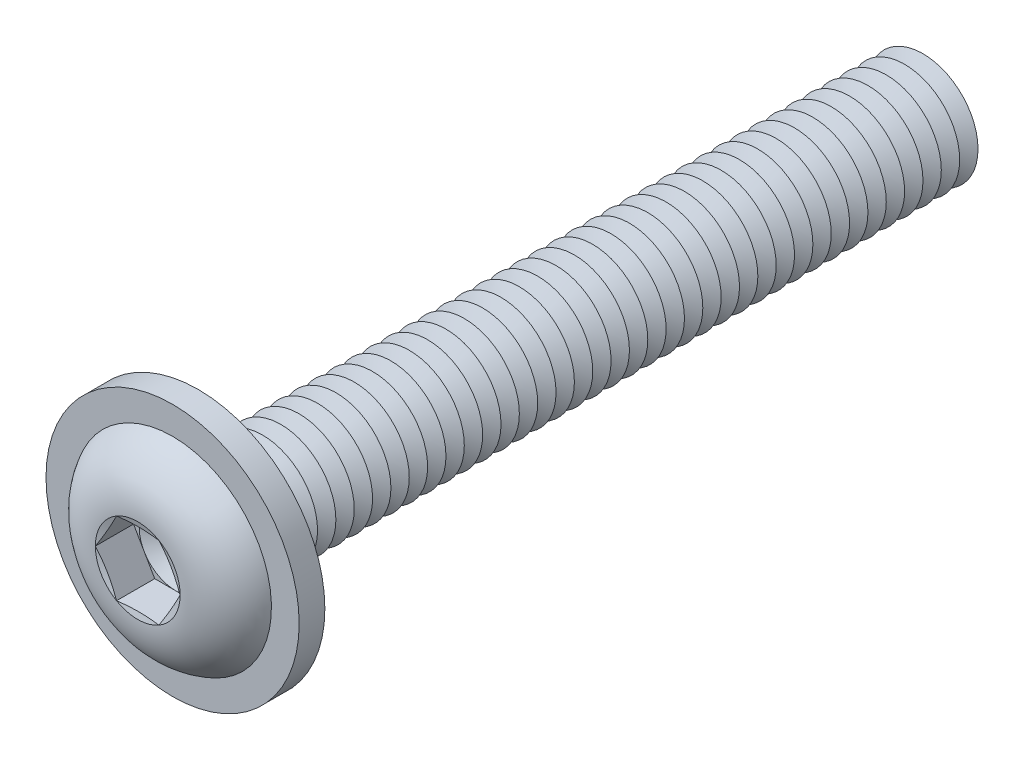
ISO-10303-21;
HEADER;
FILE_DESCRIPTION(('STEP AP214'),'2;1');
FILE_NAME('part.step','',(''),(''),'','','');
FILE_SCHEMA(('AUTOMOTIVE_DESIGN { 1 0 10303 214 1 1 1 1 }'));
ENDSEC;
DATA;
#1=APPLICATION_CONTEXT('core data for automotive mechanical design processes');
#2=APPLICATION_PROTOCOL_DEFINITION('international standard','automotive_design',2000,#1);
#3=PRODUCT_CONTEXT('',#1,'mechanical');
#4=PRODUCT('Part','Part','',(#3));
#5=PRODUCT_RELATED_PRODUCT_CATEGORY('part','',(#4));
#6=PRODUCT_DEFINITION_FORMATION('','',#4);
#7=PRODUCT_DEFINITION_CONTEXT('part definition',#1,'design');
#8=PRODUCT_DEFINITION('design','',#6,#7);
#9=PRODUCT_DEFINITION_SHAPE('','',#8);
#10=(LENGTH_UNIT() NAMED_UNIT(*) SI_UNIT(.MILLI.,.METRE.));
#11=(NAMED_UNIT(*) PLANE_ANGLE_UNIT() SI_UNIT($,.RADIAN.));
#12=(NAMED_UNIT(*) SI_UNIT($,.STERADIAN.) SOLID_ANGLE_UNIT());
#13=UNCERTAINTY_MEASURE_WITH_UNIT(LENGTH_MEASURE(1.E-05),#10,'distance_accuracy_value','');
#14=(GEOMETRIC_REPRESENTATION_CONTEXT(3) GLOBAL_UNCERTAINTY_ASSIGNED_CONTEXT((#13)) GLOBAL_UNIT_ASSIGNED_CONTEXT((#10,
#11,#12)) REPRESENTATION_CONTEXT('',''));
#15=CARTESIAN_POINT('',(0.,0.,0.));
#16=DIRECTION('',(0.,0.,1.));
#17=DIRECTION('',(1.,0.,0.));
#18=AXIS2_PLACEMENT_3D('',#15,#16,#17);
#19=CARTESIAN_POINT('',(0.,0.,-18.25));
#20=DIRECTION('',(0.,0.,1.));
#21=DIRECTION('',(1.,0.,0.));
#22=AXIS2_PLACEMENT_3D('',#19,#20,#21);
#23=CONICAL_SURFACE('',#22,1.5,1.0471975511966);
#24=CARTESIAN_POINT('',(0.,0.,-18.5));
#25=DIRECTION('',(0.,0.,1.));
#26=DIRECTION('',(1.,0.,0.));
#27=AXIS2_PLACEMENT_3D('',#24,#25,#26);
#28=CIRCLE('',#27,1.06698729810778);
#29=CARTESIAN_POINT('',(1.06698729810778,0.,-18.5));
#30=VERTEX_POINT('',#29);
#31=EDGE_CURVE('E531',#30,#30,#28,.T.);
#32=ORIENTED_EDGE('',*,*,#31,.T.);
#33=EDGE_LOOP('',(#32));
#34=FACE_BOUND('',#33,.T.);
#35=CARTESIAN_POINT('',(0.,0.,-18.25));
#36=DIRECTION('',(0.,0.,1.));
#37=DIRECTION('',(1.,0.,0.));
#38=AXIS2_PLACEMENT_3D('',#35,#36,#37);
#39=CIRCLE('',#38,1.5);
#40=CARTESIAN_POINT('',(1.5,0.,-18.25));
#41=VERTEX_POINT('',#40);
#42=EDGE_CURVE('E527',#41,#41,#39,.T.);
#43=ORIENTED_EDGE('',*,*,#42,.F.);
#44=EDGE_LOOP('',(#43));
#45=FACE_BOUND('',#44,.T.);
#46=ADVANCED_FACE('F39',(#34,#45),#23,.T.);
#47=CARTESIAN_POINT('',(0.,0.,-18.5));
#48=DIRECTION('',(0.,0.,-1.));
#49=DIRECTION('',(-1.,0.,0.));
#50=AXIS2_PLACEMENT_3D('',#47,#48,#49);
#51=CONICAL_SURFACE('',#50,1.06698729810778,1.0471975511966);
#52=CARTESIAN_POINT('',(0.,0.,-18.75));
#53=DIRECTION('',(0.,0.,1.));
#54=DIRECTION('',(1.,0.,0.));
#55=AXIS2_PLACEMENT_3D('',#52,#53,#54);
#56=CIRCLE('',#55,1.5);
#57=CARTESIAN_POINT('',(1.5,0.,-18.75));
#58=VERTEX_POINT('',#57);
#59=EDGE_CURVE('E535',#58,#58,#56,.T.);
#60=ORIENTED_EDGE('',*,*,#59,.T.);
#61=EDGE_LOOP('',(#60));
#62=FACE_BOUND('',#61,.T.);
#63=ORIENTED_EDGE('',*,*,#31,.F.);
#64=EDGE_LOOP('',(#63));
#65=FACE_BOUND('',#64,.T.);
#66=ADVANCED_FACE('F650',(#62,#65),#51,.T.);
#67=CARTESIAN_POINT('',(0.,1.50000000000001,-20.));
#68=DIRECTION('',(0.,0.,-1.));
#69=DIRECTION('',(-1.,0.,0.));
#70=AXIS2_PLACEMENT_3D('',#67,#68,#69);
#71=PLANE('',#70);
#72=CARTESIAN_POINT('',(0.,0.,-20.));
#73=DIRECTION('',(0.,0.,1.));
#74=DIRECTION('',(1.,0.,0.));
#75=AXIS2_PLACEMENT_3D('',#72,#73,#74);
#76=CIRCLE('',#75,1.06698729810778);
#77=CARTESIAN_POINT('',(1.06698729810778,0.,-20.));
#78=VERTEX_POINT('',#77);
#79=EDGE_CURVE('E555',#78,#78,#76,.T.);
#80=ORIENTED_EDGE('',*,*,#79,.F.);
#81=EDGE_LOOP('',(#80));
#82=FACE_BOUND('',#81,.T.);
#83=ADVANCED_FACE('F656',(#82),#71,.T.);
#84=CARTESIAN_POINT('',(0.,0.,-19.75));
#85=DIRECTION('',(0.,0.,1.));
#86=DIRECTION('',(1.,0.,0.));
#87=AXIS2_PLACEMENT_3D('',#84,#85,#86);
#88=CONICAL_SURFACE('',#87,1.5,1.0471975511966);
#89=ORIENTED_EDGE('',*,*,#79,.T.);
#90=EDGE_LOOP('',(#89));
#91=FACE_BOUND('',#90,.T.);
#92=CARTESIAN_POINT('',(0.,0.,-19.75));
#93=DIRECTION('',(0.,0.,1.));
#94=DIRECTION('',(1.,0.,0.));
#95=AXIS2_PLACEMENT_3D('',#92,#93,#94);
#96=CIRCLE('',#95,1.5);
#97=CARTESIAN_POINT('',(1.5,0.,-19.75));
#98=VERTEX_POINT('',#97);
#99=EDGE_CURVE('E551',#98,#98,#96,.T.);
#100=ORIENTED_EDGE('',*,*,#99,.F.);
#101=EDGE_LOOP('',(#100));
#102=FACE_BOUND('',#101,.T.);
#103=ADVANCED_FACE('F675',(#91,#102),#88,.T.);
#104=CARTESIAN_POINT('',(0.,0.,-19.5));
#105=DIRECTION('',(0.,0.,-1.));
#106=DIRECTION('',(-1.,0.,0.));
#107=AXIS2_PLACEMENT_3D('',#104,#105,#106);
#108=CONICAL_SURFACE('',#107,1.06698729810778,1.0471975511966);
#109=ORIENTED_EDGE('',*,*,#99,.T.);
#110=EDGE_LOOP('',(#109));
#111=FACE_BOUND('',#110,.T.);
#112=CARTESIAN_POINT('',(0.,0.,-19.5));
#113=DIRECTION('',(0.,0.,1.));
#114=DIRECTION('',(1.,0.,0.));
#115=AXIS2_PLACEMENT_3D('',#112,#113,#114);
#116=CIRCLE('',#115,1.06698729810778);
#117=CARTESIAN_POINT('',(1.06698729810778,0.,-19.5));
#118=VERTEX_POINT('',#117);
#119=EDGE_CURVE('E547',#118,#118,#116,.T.);
#120=ORIENTED_EDGE('',*,*,#119,.F.);
#121=EDGE_LOOP('',(#120));
#122=FACE_BOUND('',#121,.T.);
#123=ADVANCED_FACE('F672',(#111,#122),#108,.T.);
#124=CARTESIAN_POINT('',(0.,0.,-19.25));
#125=DIRECTION('',(0.,0.,1.));
#126=DIRECTION('',(1.,0.,0.));
#127=AXIS2_PLACEMENT_3D('',#124,#125,#126);
#128=CONICAL_SURFACE('',#127,1.5,1.0471975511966);
#129=ORIENTED_EDGE('',*,*,#119,.T.);
#130=EDGE_LOOP('',(#129));
#131=FACE_BOUND('',#130,.T.);
#132=CARTESIAN_POINT('',(0.,0.,-19.25));
#133=DIRECTION('',(0.,0.,1.));
#134=DIRECTION('',(1.,0.,0.));
#135=AXIS2_PLACEMENT_3D('',#132,#133,#134);
#136=CIRCLE('',#135,1.5);
#137=CARTESIAN_POINT('',(1.5,0.,-19.25));
#138=VERTEX_POINT('',#137);
#139=EDGE_CURVE('E543',#138,#138,#136,.T.);
#140=ORIENTED_EDGE('',*,*,#139,.F.);
#141=EDGE_LOOP('',(#140));
#142=FACE_BOUND('',#141,.T.);
#143=ADVANCED_FACE('F666',(#131,#142),#128,.T.);
#144=CARTESIAN_POINT('',(0.,0.,-19.));
#145=DIRECTION('',(0.,0.,-1.));
#146=DIRECTION('',(-1.,0.,0.));
#147=AXIS2_PLACEMENT_3D('',#144,#145,#146);
#148=CONICAL_SURFACE('',#147,1.06698729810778,1.0471975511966);
#149=ORIENTED_EDGE('',*,*,#139,.T.);
#150=EDGE_LOOP('',(#149));
#151=FACE_BOUND('',#150,.T.);
#152=CARTESIAN_POINT('',(0.,0.,-19.));
#153=DIRECTION('',(0.,0.,1.));
#154=DIRECTION('',(1.,0.,0.));
#155=AXIS2_PLACEMENT_3D('',#152,#153,#154);
#156=CIRCLE('',#155,1.06698729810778);
#157=CARTESIAN_POINT('',(1.06698729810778,0.,-19.));
#158=VERTEX_POINT('',#157);
#159=EDGE_CURVE('E539',#158,#158,#156,.T.);
#160=ORIENTED_EDGE('',*,*,#159,.F.);
#161=EDGE_LOOP('',(#160));
#162=FACE_BOUND('',#161,.T.);
#163=ADVANCED_FACE('F662',(#151,#162),#148,.T.);
#164=CARTESIAN_POINT('',(0.,0.,-18.75));
#165=DIRECTION('',(0.,0.,1.));
#166=DIRECTION('',(1.,0.,0.));
#167=AXIS2_PLACEMENT_3D('',#164,#165,#166);
#168=CONICAL_SURFACE('',#167,1.5,1.0471975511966);
#169=ORIENTED_EDGE('',*,*,#159,.T.);
#170=EDGE_LOOP('',(#169));
#171=FACE_BOUND('',#170,.T.);
#172=ORIENTED_EDGE('',*,*,#59,.F.);
#173=EDGE_LOOP('',(#172));
#174=FACE_BOUND('',#173,.T.);
#175=ADVANCED_FACE('F665',(#171,#174),#168,.T.);
#176=CARTESIAN_POINT('',(0.,0.,-17.75));
#177=DIRECTION('',(0.,0.,1.));
#178=DIRECTION('',(1.,0.,0.));
#179=AXIS2_PLACEMENT_3D('',#176,#177,#178);
#180=CONICAL_SURFACE('',#179,1.5,1.0471975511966);
#181=CARTESIAN_POINT('',(0.,0.,-18.));
#182=DIRECTION('',(0.,0.,1.));
#183=DIRECTION('',(1.,0.,0.));
#184=AXIS2_PLACEMENT_3D('',#181,#182,#183);
#185=CIRCLE('',#184,1.06698729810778);
#186=CARTESIAN_POINT('',(1.06698729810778,0.,-18.));
#187=VERTEX_POINT('',#186);
#188=EDGE_CURVE('E523',#187,#187,#185,.T.);
#189=ORIENTED_EDGE('',*,*,#188,.T.);
#190=EDGE_LOOP('',(#189));
#191=FACE_BOUND('',#190,.T.);
#192=CARTESIAN_POINT('',(0.,0.,-17.75));
#193=DIRECTION('',(0.,0.,1.));
#194=DIRECTION('',(1.,0.,0.));
#195=AXIS2_PLACEMENT_3D('',#192,#193,#194);
#196=CIRCLE('',#195,1.5);
#197=CARTESIAN_POINT('',(1.5,0.,-17.75));
#198=VERTEX_POINT('',#197);
#199=EDGE_CURVE('E519',#198,#198,#196,.T.);
#200=ORIENTED_EDGE('',*,*,#199,.F.);
#201=EDGE_LOOP('',(#200));
#202=FACE_BOUND('',#201,.T.);
#203=ADVANCED_FACE('F670',(#191,#202),#180,.T.);
#204=CARTESIAN_POINT('',(0.,0.,-18.));
#205=DIRECTION('',(0.,0.,-1.));
#206=DIRECTION('',(-1.,0.,0.));
#207=AXIS2_PLACEMENT_3D('',#204,#205,#206);
#208=CONICAL_SURFACE('',#207,1.06698729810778,1.0471975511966);
#209=ORIENTED_EDGE('',*,*,#42,.T.);
#210=EDGE_LOOP('',(#209));
#211=FACE_BOUND('',#210,.T.);
#212=ORIENTED_EDGE('',*,*,#188,.F.);
#213=EDGE_LOOP('',(#212));
#214=FACE_BOUND('',#213,.T.);
#215=ADVANCED_FACE('F721',(#211,#214),#208,.T.);
#216=CARTESIAN_POINT('',(0.,0.,-17.25));
#217=DIRECTION('',(0.,0.,1.));
#218=DIRECTION('',(1.,0.,0.));
#219=AXIS2_PLACEMENT_3D('',#216,#217,#218);
#220=CONICAL_SURFACE('',#219,1.5,1.0471975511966);
#221=CARTESIAN_POINT('',(0.,0.,-17.5));
#222=DIRECTION('',(0.,0.,1.));
#223=DIRECTION('',(1.,0.,0.));
#224=AXIS2_PLACEMENT_3D('',#221,#222,#223);
#225=CIRCLE('',#224,1.06698729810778);
#226=CARTESIAN_POINT('',(1.06698729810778,0.,-17.5));
#227=VERTEX_POINT('',#226);
#228=EDGE_CURVE('E515',#227,#227,#225,.T.);
#229=ORIENTED_EDGE('',*,*,#228,.T.);
#230=EDGE_LOOP('',(#229));
#231=FACE_BOUND('',#230,.T.);
#232=CARTESIAN_POINT('',(0.,0.,-17.25));
#233=DIRECTION('',(0.,0.,1.));
#234=DIRECTION('',(1.,0.,0.));
#235=AXIS2_PLACEMENT_3D('',#232,#233,#234);
#236=CIRCLE('',#235,1.5);
#237=CARTESIAN_POINT('',(1.5,0.,-17.25));
#238=VERTEX_POINT('',#237);
#239=EDGE_CURVE('E511',#238,#238,#236,.T.);
#240=ORIENTED_EDGE('',*,*,#239,.F.);
#241=EDGE_LOOP('',(#240));
#242=FACE_BOUND('',#241,.T.);
#243=ADVANCED_FACE('F727',(#231,#242),#220,.T.);
#244=CARTESIAN_POINT('',(0.,0.,-17.5));
#245=DIRECTION('',(0.,0.,-1.));
#246=DIRECTION('',(-1.,0.,0.));
#247=AXIS2_PLACEMENT_3D('',#244,#245,#246);
#248=CONICAL_SURFACE('',#247,1.06698729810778,1.0471975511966);
#249=ORIENTED_EDGE('',*,*,#199,.T.);
#250=EDGE_LOOP('',(#249));
#251=FACE_BOUND('',#250,.T.);
#252=ORIENTED_EDGE('',*,*,#228,.F.);
#253=EDGE_LOOP('',(#252));
#254=FACE_BOUND('',#253,.T.);
#255=ADVANCED_FACE('F734',(#251,#254),#248,.T.);
#256=CARTESIAN_POINT('',(0.,0.,-16.75));
#257=DIRECTION('',(0.,0.,1.));
#258=DIRECTION('',(1.,0.,0.));
#259=AXIS2_PLACEMENT_3D('',#256,#257,#258);
#260=CONICAL_SURFACE('',#259,1.5,1.0471975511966);
#261=CARTESIAN_POINT('',(0.,0.,-17.));
#262=DIRECTION('',(0.,0.,1.));
#263=DIRECTION('',(1.,0.,0.));
#264=AXIS2_PLACEMENT_3D('',#261,#262,#263);
#265=CIRCLE('',#264,1.06698729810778);
#266=CARTESIAN_POINT('',(1.06698729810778,0.,-17.));
#267=VERTEX_POINT('',#266);
#268=EDGE_CURVE('E507',#267,#267,#265,.T.);
#269=ORIENTED_EDGE('',*,*,#268,.T.);
#270=EDGE_LOOP('',(#269));
#271=FACE_BOUND('',#270,.T.);
#272=CARTESIAN_POINT('',(0.,0.,-16.75));
#273=DIRECTION('',(0.,0.,1.));
#274=DIRECTION('',(1.,0.,0.));
#275=AXIS2_PLACEMENT_3D('',#272,#273,#274);
#276=CIRCLE('',#275,1.5);
#277=CARTESIAN_POINT('',(1.5,0.,-16.75));
#278=VERTEX_POINT('',#277);
#279=EDGE_CURVE('E503',#278,#278,#276,.T.);
#280=ORIENTED_EDGE('',*,*,#279,.F.);
#281=EDGE_LOOP('',(#280));
#282=FACE_BOUND('',#281,.T.);
#283=ADVANCED_FACE('F741',(#271,#282),#260,.T.);
#284=CARTESIAN_POINT('',(0.,0.,-17.));
#285=DIRECTION('',(0.,0.,-1.));
#286=DIRECTION('',(-1.,0.,0.));
#287=AXIS2_PLACEMENT_3D('',#284,#285,#286);
#288=CONICAL_SURFACE('',#287,1.06698729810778,1.0471975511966);
#289=ORIENTED_EDGE('',*,*,#239,.T.);
#290=EDGE_LOOP('',(#289));
#291=FACE_BOUND('',#290,.T.);
#292=ORIENTED_EDGE('',*,*,#268,.F.);
#293=EDGE_LOOP('',(#292));
#294=FACE_BOUND('',#293,.T.);
#295=ADVANCED_FACE('F748',(#291,#294),#288,.T.);
#296=CARTESIAN_POINT('',(0.,0.,-16.25));
#297=DIRECTION('',(0.,0.,1.));
#298=DIRECTION('',(1.,0.,0.));
#299=AXIS2_PLACEMENT_3D('',#296,#297,#298);
#300=CONICAL_SURFACE('',#299,1.5,1.0471975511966);
#301=CARTESIAN_POINT('',(0.,0.,-16.5));
#302=DIRECTION('',(0.,0.,1.));
#303=DIRECTION('',(1.,0.,0.));
#304=AXIS2_PLACEMENT_3D('',#301,#302,#303);
#305=CIRCLE('',#304,1.06698729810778);
#306=CARTESIAN_POINT('',(1.06698729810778,0.,-16.5));
#307=VERTEX_POINT('',#306);
#308=EDGE_CURVE('E499',#307,#307,#305,.T.);
#309=ORIENTED_EDGE('',*,*,#308,.T.);
#310=EDGE_LOOP('',(#309));
#311=FACE_BOUND('',#310,.T.);
#312=CARTESIAN_POINT('',(0.,0.,-16.25));
#313=DIRECTION('',(0.,0.,1.));
#314=DIRECTION('',(1.,0.,0.));
#315=AXIS2_PLACEMENT_3D('',#312,#313,#314);
#316=CIRCLE('',#315,1.5);
#317=CARTESIAN_POINT('',(1.5,0.,-16.25));
#318=VERTEX_POINT('',#317);
#319=EDGE_CURVE('E495',#318,#318,#316,.T.);
#320=ORIENTED_EDGE('',*,*,#319,.F.);
#321=EDGE_LOOP('',(#320));
#322=FACE_BOUND('',#321,.T.);
#323=ADVANCED_FACE('F755',(#311,#322),#300,.T.);
#324=CARTESIAN_POINT('',(0.,0.,-16.5));
#325=DIRECTION('',(0.,0.,-1.));
#326=DIRECTION('',(-1.,0.,0.));
#327=AXIS2_PLACEMENT_3D('',#324,#325,#326);
#328=CONICAL_SURFACE('',#327,1.06698729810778,1.0471975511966);
#329=ORIENTED_EDGE('',*,*,#279,.T.);
#330=EDGE_LOOP('',(#329));
#331=FACE_BOUND('',#330,.T.);
#332=ORIENTED_EDGE('',*,*,#308,.F.);
#333=EDGE_LOOP('',(#332));
#334=FACE_BOUND('',#333,.T.);
#335=ADVANCED_FACE('F762',(#331,#334),#328,.T.);
#336=CARTESIAN_POINT('',(0.,0.,-15.75));
#337=DIRECTION('',(0.,0.,1.));
#338=DIRECTION('',(1.,0.,0.));
#339=AXIS2_PLACEMENT_3D('',#336,#337,#338);
#340=CONICAL_SURFACE('',#339,1.5,1.0471975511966);
#341=CARTESIAN_POINT('',(0.,0.,-16.));
#342=DIRECTION('',(0.,0.,1.));
#343=DIRECTION('',(1.,0.,0.));
#344=AXIS2_PLACEMENT_3D('',#341,#342,#343);
#345=CIRCLE('',#344,1.06698729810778);
#346=CARTESIAN_POINT('',(1.06698729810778,0.,-16.));
#347=VERTEX_POINT('',#346);
#348=EDGE_CURVE('E491',#347,#347,#345,.T.);
#349=ORIENTED_EDGE('',*,*,#348,.T.);
#350=EDGE_LOOP('',(#349));
#351=FACE_BOUND('',#350,.T.);
#352=CARTESIAN_POINT('',(0.,0.,-15.75));
#353=DIRECTION('',(0.,0.,1.));
#354=DIRECTION('',(1.,0.,0.));
#355=AXIS2_PLACEMENT_3D('',#352,#353,#354);
#356=CIRCLE('',#355,1.5);
#357=CARTESIAN_POINT('',(1.5,0.,-15.75));
#358=VERTEX_POINT('',#357);
#359=EDGE_CURVE('E487',#358,#358,#356,.T.);
#360=ORIENTED_EDGE('',*,*,#359,.F.);
#361=EDGE_LOOP('',(#360));
#362=FACE_BOUND('',#361,.T.);
#363=ADVANCED_FACE('F769',(#351,#362),#340,.T.);
#364=CARTESIAN_POINT('',(0.,0.,-16.));
#365=DIRECTION('',(0.,0.,-1.));
#366=DIRECTION('',(-1.,0.,0.));
#367=AXIS2_PLACEMENT_3D('',#364,#365,#366);
#368=CONICAL_SURFACE('',#367,1.06698729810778,1.0471975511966);
#369=ORIENTED_EDGE('',*,*,#319,.T.);
#370=EDGE_LOOP('',(#369));
#371=FACE_BOUND('',#370,.T.);
#372=ORIENTED_EDGE('',*,*,#348,.F.);
#373=EDGE_LOOP('',(#372));
#374=FACE_BOUND('',#373,.T.);
#375=ADVANCED_FACE('F776',(#371,#374),#368,.T.);
#376=CARTESIAN_POINT('',(0.,0.,-15.25));
#377=DIRECTION('',(0.,0.,1.));
#378=DIRECTION('',(1.,0.,0.));
#379=AXIS2_PLACEMENT_3D('',#376,#377,#378);
#380=CONICAL_SURFACE('',#379,1.5,1.0471975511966);
#381=CARTESIAN_POINT('',(0.,0.,-15.5));
#382=DIRECTION('',(0.,0.,1.));
#383=DIRECTION('',(1.,0.,0.));
#384=AXIS2_PLACEMENT_3D('',#381,#382,#383);
#385=CIRCLE('',#384,1.06698729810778);
#386=CARTESIAN_POINT('',(1.06698729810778,0.,-15.5));
#387=VERTEX_POINT('',#386);
#388=EDGE_CURVE('E483',#387,#387,#385,.T.);
#389=ORIENTED_EDGE('',*,*,#388,.T.);
#390=EDGE_LOOP('',(#389));
#391=FACE_BOUND('',#390,.T.);
#392=CARTESIAN_POINT('',(0.,0.,-15.25));
#393=DIRECTION('',(0.,0.,1.));
#394=DIRECTION('',(1.,0.,0.));
#395=AXIS2_PLACEMENT_3D('',#392,#393,#394);
#396=CIRCLE('',#395,1.5);
#397=CARTESIAN_POINT('',(1.5,0.,-15.25));
#398=VERTEX_POINT('',#397);
#399=EDGE_CURVE('E479',#398,#398,#396,.T.);
#400=ORIENTED_EDGE('',*,*,#399,.F.);
#401=EDGE_LOOP('',(#400));
#402=FACE_BOUND('',#401,.T.);
#403=ADVANCED_FACE('F783',(#391,#402),#380,.T.);
#404=CARTESIAN_POINT('',(0.,0.,-15.5));
#405=DIRECTION('',(0.,0.,-1.));
#406=DIRECTION('',(-1.,0.,0.));
#407=AXIS2_PLACEMENT_3D('',#404,#405,#406);
#408=CONICAL_SURFACE('',#407,1.06698729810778,1.0471975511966);
#409=ORIENTED_EDGE('',*,*,#359,.T.);
#410=EDGE_LOOP('',(#409));
#411=FACE_BOUND('',#410,.T.);
#412=ORIENTED_EDGE('',*,*,#388,.F.);
#413=EDGE_LOOP('',(#412));
#414=FACE_BOUND('',#413,.T.);
#415=ADVANCED_FACE('F790',(#411,#414),#408,.T.);
#416=CARTESIAN_POINT('',(0.,0.,-14.75));
#417=DIRECTION('',(0.,0.,1.));
#418=DIRECTION('',(1.,0.,0.));
#419=AXIS2_PLACEMENT_3D('',#416,#417,#418);
#420=CONICAL_SURFACE('',#419,1.5,1.0471975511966);
#421=CARTESIAN_POINT('',(0.,0.,-15.));
#422=DIRECTION('',(0.,0.,1.));
#423=DIRECTION('',(1.,0.,0.));
#424=AXIS2_PLACEMENT_3D('',#421,#422,#423);
#425=CIRCLE('',#424,1.06698729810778);
#426=CARTESIAN_POINT('',(1.06698729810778,0.,-15.));
#427=VERTEX_POINT('',#426);
#428=EDGE_CURVE('E475',#427,#427,#425,.T.);
#429=ORIENTED_EDGE('',*,*,#428,.T.);
#430=EDGE_LOOP('',(#429));
#431=FACE_BOUND('',#430,.T.);
#432=CARTESIAN_POINT('',(0.,0.,-14.75));
#433=DIRECTION('',(0.,0.,1.));
#434=DIRECTION('',(1.,0.,0.));
#435=AXIS2_PLACEMENT_3D('',#432,#433,#434);
#436=CIRCLE('',#435,1.5);
#437=CARTESIAN_POINT('',(1.5,0.,-14.75));
#438=VERTEX_POINT('',#437);
#439=EDGE_CURVE('E471',#438,#438,#436,.T.);
#440=ORIENTED_EDGE('',*,*,#439,.F.);
#441=EDGE_LOOP('',(#440));
#442=FACE_BOUND('',#441,.T.);
#443=ADVANCED_FACE('F797',(#431,#442),#420,.T.);
#444=CARTESIAN_POINT('',(0.,0.,-15.));
#445=DIRECTION('',(0.,0.,-1.));
#446=DIRECTION('',(-1.,0.,0.));
#447=AXIS2_PLACEMENT_3D('',#444,#445,#446);
#448=CONICAL_SURFACE('',#447,1.06698729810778,1.0471975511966);
#449=ORIENTED_EDGE('',*,*,#399,.T.);
#450=EDGE_LOOP('',(#449));
#451=FACE_BOUND('',#450,.T.);
#452=ORIENTED_EDGE('',*,*,#428,.F.);
#453=EDGE_LOOP('',(#452));
#454=FACE_BOUND('',#453,.T.);
#455=ADVANCED_FACE('F804',(#451,#454),#448,.T.);
#456=CARTESIAN_POINT('',(0.,0.,-14.25));
#457=DIRECTION('',(0.,0.,1.));
#458=DIRECTION('',(1.,0.,0.));
#459=AXIS2_PLACEMENT_3D('',#456,#457,#458);
#460=CONICAL_SURFACE('',#459,1.5,1.0471975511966);
#461=CARTESIAN_POINT('',(0.,0.,-14.5));
#462=DIRECTION('',(0.,0.,1.));
#463=DIRECTION('',(1.,0.,0.));
#464=AXIS2_PLACEMENT_3D('',#461,#462,#463);
#465=CIRCLE('',#464,1.06698729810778);
#466=CARTESIAN_POINT('',(1.06698729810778,0.,-14.5));
#467=VERTEX_POINT('',#466);
#468=EDGE_CURVE('E467',#467,#467,#465,.T.);
#469=ORIENTED_EDGE('',*,*,#468,.T.);
#470=EDGE_LOOP('',(#469));
#471=FACE_BOUND('',#470,.T.);
#472=CARTESIAN_POINT('',(0.,0.,-14.25));
#473=DIRECTION('',(0.,0.,1.));
#474=DIRECTION('',(1.,0.,0.));
#475=AXIS2_PLACEMENT_3D('',#472,#473,#474);
#476=CIRCLE('',#475,1.5);
#477=CARTESIAN_POINT('',(1.5,0.,-14.25));
#478=VERTEX_POINT('',#477);
#479=EDGE_CURVE('E463',#478,#478,#476,.T.);
#480=ORIENTED_EDGE('',*,*,#479,.F.);
#481=EDGE_LOOP('',(#480));
#482=FACE_BOUND('',#481,.T.);
#483=ADVANCED_FACE('F811',(#471,#482),#460,.T.);
#484=CARTESIAN_POINT('',(0.,0.,-14.5));
#485=DIRECTION('',(0.,0.,-1.));
#486=DIRECTION('',(-1.,0.,0.));
#487=AXIS2_PLACEMENT_3D('',#484,#485,#486);
#488=CONICAL_SURFACE('',#487,1.06698729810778,1.0471975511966);
#489=ORIENTED_EDGE('',*,*,#439,.T.);
#490=EDGE_LOOP('',(#489));
#491=FACE_BOUND('',#490,.T.);
#492=ORIENTED_EDGE('',*,*,#468,.F.);
#493=EDGE_LOOP('',(#492));
#494=FACE_BOUND('',#493,.T.);
#495=ADVANCED_FACE('F818',(#491,#494),#488,.T.);
#496=CARTESIAN_POINT('',(0.,0.,-13.75));
#497=DIRECTION('',(0.,0.,1.));
#498=DIRECTION('',(1.,0.,0.));
#499=AXIS2_PLACEMENT_3D('',#496,#497,#498);
#500=CONICAL_SURFACE('',#499,1.5,1.0471975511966);
#501=CARTESIAN_POINT('',(0.,0.,-14.));
#502=DIRECTION('',(0.,0.,1.));
#503=DIRECTION('',(1.,0.,0.));
#504=AXIS2_PLACEMENT_3D('',#501,#502,#503);
#505=CIRCLE('',#504,1.06698729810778);
#506=CARTESIAN_POINT('',(1.06698729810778,0.,-14.));
#507=VERTEX_POINT('',#506);
#508=EDGE_CURVE('E459',#507,#507,#505,.T.);
#509=ORIENTED_EDGE('',*,*,#508,.T.);
#510=EDGE_LOOP('',(#509));
#511=FACE_BOUND('',#510,.T.);
#512=CARTESIAN_POINT('',(0.,0.,-13.75));
#513=DIRECTION('',(0.,0.,1.));
#514=DIRECTION('',(1.,0.,0.));
#515=AXIS2_PLACEMENT_3D('',#512,#513,#514);
#516=CIRCLE('',#515,1.5);
#517=CARTESIAN_POINT('',(1.5,0.,-13.75));
#518=VERTEX_POINT('',#517);
#519=EDGE_CURVE('E455',#518,#518,#516,.T.);
#520=ORIENTED_EDGE('',*,*,#519,.F.);
#521=EDGE_LOOP('',(#520));
#522=FACE_BOUND('',#521,.T.);
#523=ADVANCED_FACE('F825',(#511,#522),#500,.T.);
#524=CARTESIAN_POINT('',(0.,0.,-14.));
#525=DIRECTION('',(0.,0.,-1.));
#526=DIRECTION('',(-1.,0.,0.));
#527=AXIS2_PLACEMENT_3D('',#524,#525,#526);
#528=CONICAL_SURFACE('',#527,1.06698729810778,1.0471975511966);
#529=ORIENTED_EDGE('',*,*,#479,.T.);
#530=EDGE_LOOP('',(#529));
#531=FACE_BOUND('',#530,.T.);
#532=ORIENTED_EDGE('',*,*,#508,.F.);
#533=EDGE_LOOP('',(#532));
#534=FACE_BOUND('',#533,.T.);
#535=ADVANCED_FACE('F832',(#531,#534),#528,.T.);
#536=CARTESIAN_POINT('',(0.,0.,-13.25));
#537=DIRECTION('',(0.,0.,1.));
#538=DIRECTION('',(1.,0.,0.));
#539=AXIS2_PLACEMENT_3D('',#536,#537,#538);
#540=CONICAL_SURFACE('',#539,1.5,1.0471975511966);
#541=CARTESIAN_POINT('',(0.,0.,-13.5));
#542=DIRECTION('',(0.,0.,1.));
#543=DIRECTION('',(1.,0.,0.));
#544=AXIS2_PLACEMENT_3D('',#541,#542,#543);
#545=CIRCLE('',#544,1.06698729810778);
#546=CARTESIAN_POINT('',(1.06698729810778,0.,-13.5));
#547=VERTEX_POINT('',#546);
#548=EDGE_CURVE('E451',#547,#547,#545,.T.);
#549=ORIENTED_EDGE('',*,*,#548,.T.);
#550=EDGE_LOOP('',(#549));
#551=FACE_BOUND('',#550,.T.);
#552=CARTESIAN_POINT('',(0.,0.,-13.25));
#553=DIRECTION('',(0.,0.,1.));
#554=DIRECTION('',(1.,0.,0.));
#555=AXIS2_PLACEMENT_3D('',#552,#553,#554);
#556=CIRCLE('',#555,1.5);
#557=CARTESIAN_POINT('',(1.5,0.,-13.25));
#558=VERTEX_POINT('',#557);
#559=EDGE_CURVE('E447',#558,#558,#556,.T.);
#560=ORIENTED_EDGE('',*,*,#559,.F.);
#561=EDGE_LOOP('',(#560));
#562=FACE_BOUND('',#561,.T.);
#563=ADVANCED_FACE('F839',(#551,#562),#540,.T.);
#564=CARTESIAN_POINT('',(0.,0.,-13.5));
#565=DIRECTION('',(0.,0.,-1.));
#566=DIRECTION('',(-1.,0.,0.));
#567=AXIS2_PLACEMENT_3D('',#564,#565,#566);
#568=CONICAL_SURFACE('',#567,1.06698729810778,1.0471975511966);
#569=ORIENTED_EDGE('',*,*,#519,.T.);
#570=EDGE_LOOP('',(#569));
#571=FACE_BOUND('',#570,.T.);
#572=ORIENTED_EDGE('',*,*,#548,.F.);
#573=EDGE_LOOP('',(#572));
#574=FACE_BOUND('',#573,.T.);
#575=ADVANCED_FACE('F846',(#571,#574),#568,.T.);
#576=CARTESIAN_POINT('',(0.,0.,-12.75));
#577=DIRECTION('',(0.,0.,1.));
#578=DIRECTION('',(1.,0.,0.));
#579=AXIS2_PLACEMENT_3D('',#576,#577,#578);
#580=CONICAL_SURFACE('',#579,1.5,1.0471975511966);
#581=CARTESIAN_POINT('',(0.,0.,-13.));
#582=DIRECTION('',(0.,0.,1.));
#583=DIRECTION('',(1.,0.,0.));
#584=AXIS2_PLACEMENT_3D('',#581,#582,#583);
#585=CIRCLE('',#584,1.06698729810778);
#586=CARTESIAN_POINT('',(1.06698729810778,0.,-13.));
#587=VERTEX_POINT('',#586);
#588=EDGE_CURVE('E443',#587,#587,#585,.T.);
#589=ORIENTED_EDGE('',*,*,#588,.T.);
#590=EDGE_LOOP('',(#589));
#591=FACE_BOUND('',#590,.T.);
#592=CARTESIAN_POINT('',(0.,0.,-12.75));
#593=DIRECTION('',(0.,0.,1.));
#594=DIRECTION('',(1.,0.,0.));
#595=AXIS2_PLACEMENT_3D('',#592,#593,#594);
#596=CIRCLE('',#595,1.5);
#597=CARTESIAN_POINT('',(1.5,0.,-12.75));
#598=VERTEX_POINT('',#597);
#599=EDGE_CURVE('E439',#598,#598,#596,.T.);
#600=ORIENTED_EDGE('',*,*,#599,.F.);
#601=EDGE_LOOP('',(#600));
#602=FACE_BOUND('',#601,.T.);
#603=ADVANCED_FACE('F853',(#591,#602),#580,.T.);
#604=CARTESIAN_POINT('',(0.,0.,-13.));
#605=DIRECTION('',(0.,0.,-1.));
#606=DIRECTION('',(-1.,0.,0.));
#607=AXIS2_PLACEMENT_3D('',#604,#605,#606);
#608=CONICAL_SURFACE('',#607,1.06698729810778,1.0471975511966);
#609=ORIENTED_EDGE('',*,*,#559,.T.);
#610=EDGE_LOOP('',(#609));
#611=FACE_BOUND('',#610,.T.);
#612=ORIENTED_EDGE('',*,*,#588,.F.);
#613=EDGE_LOOP('',(#612));
#614=FACE_BOUND('',#613,.T.);
#615=ADVANCED_FACE('F860',(#611,#614),#608,.T.);
#616=CARTESIAN_POINT('',(0.,0.,-12.25));
#617=DIRECTION('',(0.,0.,1.));
#618=DIRECTION('',(1.,0.,0.));
#619=AXIS2_PLACEMENT_3D('',#616,#617,#618);
#620=CONICAL_SURFACE('',#619,1.5,1.0471975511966);
#621=CARTESIAN_POINT('',(0.,0.,-12.5));
#622=DIRECTION('',(0.,0.,1.));
#623=DIRECTION('',(1.,0.,0.));
#624=AXIS2_PLACEMENT_3D('',#621,#622,#623);
#625=CIRCLE('',#624,1.06698729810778);
#626=CARTESIAN_POINT('',(1.06698729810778,0.,-12.5));
#627=VERTEX_POINT('',#626);
#628=EDGE_CURVE('E435',#627,#627,#625,.T.);
#629=ORIENTED_EDGE('',*,*,#628,.T.);
#630=EDGE_LOOP('',(#629));
#631=FACE_BOUND('',#630,.T.);
#632=CARTESIAN_POINT('',(0.,0.,-12.25));
#633=DIRECTION('',(0.,0.,1.));
#634=DIRECTION('',(1.,0.,0.));
#635=AXIS2_PLACEMENT_3D('',#632,#633,#634);
#636=CIRCLE('',#635,1.5);
#637=CARTESIAN_POINT('',(1.5,0.,-12.25));
#638=VERTEX_POINT('',#637);
#639=EDGE_CURVE('E431',#638,#638,#636,.T.);
#640=ORIENTED_EDGE('',*,*,#639,.F.);
#641=EDGE_LOOP('',(#640));
#642=FACE_BOUND('',#641,.T.);
#643=ADVANCED_FACE('F867',(#631,#642),#620,.T.);
#644=CARTESIAN_POINT('',(0.,0.,-12.5));
#645=DIRECTION('',(0.,0.,-1.));
#646=DIRECTION('',(-1.,0.,0.));
#647=AXIS2_PLACEMENT_3D('',#644,#645,#646);
#648=CONICAL_SURFACE('',#647,1.06698729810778,1.0471975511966);
#649=ORIENTED_EDGE('',*,*,#599,.T.);
#650=EDGE_LOOP('',(#649));
#651=FACE_BOUND('',#650,.T.);
#652=ORIENTED_EDGE('',*,*,#628,.F.);
#653=EDGE_LOOP('',(#652));
#654=FACE_BOUND('',#653,.T.);
#655=ADVANCED_FACE('F874',(#651,#654),#648,.T.);
#656=CARTESIAN_POINT('',(0.,0.,-11.75));
#657=DIRECTION('',(0.,0.,1.));
#658=DIRECTION('',(1.,0.,0.));
#659=AXIS2_PLACEMENT_3D('',#656,#657,#658);
#660=CONICAL_SURFACE('',#659,1.5,1.0471975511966);
#661=CARTESIAN_POINT('',(0.,0.,-12.));
#662=DIRECTION('',(0.,0.,1.));
#663=DIRECTION('',(1.,0.,0.));
#664=AXIS2_PLACEMENT_3D('',#661,#662,#663);
#665=CIRCLE('',#664,1.06698729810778);
#666=CARTESIAN_POINT('',(1.06698729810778,0.,-12.));
#667=VERTEX_POINT('',#666);
#668=EDGE_CURVE('E427',#667,#667,#665,.T.);
#669=ORIENTED_EDGE('',*,*,#668,.T.);
#670=EDGE_LOOP('',(#669));
#671=FACE_BOUND('',#670,.T.);
#672=CARTESIAN_POINT('',(0.,0.,-11.75));
#673=DIRECTION('',(0.,0.,1.));
#674=DIRECTION('',(1.,0.,0.));
#675=AXIS2_PLACEMENT_3D('',#672,#673,#674);
#676=CIRCLE('',#675,1.5);
#677=CARTESIAN_POINT('',(1.5,0.,-11.75));
#678=VERTEX_POINT('',#677);
#679=EDGE_CURVE('E423',#678,#678,#676,.T.);
#680=ORIENTED_EDGE('',*,*,#679,.F.);
#681=EDGE_LOOP('',(#680));
#682=FACE_BOUND('',#681,.T.);
#683=ADVANCED_FACE('F881',(#671,#682),#660,.T.);
#684=CARTESIAN_POINT('',(0.,0.,-12.));
#685=DIRECTION('',(0.,0.,-1.));
#686=DIRECTION('',(-1.,0.,0.));
#687=AXIS2_PLACEMENT_3D('',#684,#685,#686);
#688=CONICAL_SURFACE('',#687,1.06698729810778,1.0471975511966);
#689=ORIENTED_EDGE('',*,*,#639,.T.);
#690=EDGE_LOOP('',(#689));
#691=FACE_BOUND('',#690,.T.);
#692=ORIENTED_EDGE('',*,*,#668,.F.);
#693=EDGE_LOOP('',(#692));
#694=FACE_BOUND('',#693,.T.);
#695=ADVANCED_FACE('F888',(#691,#694),#688,.T.);
#696=CARTESIAN_POINT('',(0.,0.,-11.25));
#697=DIRECTION('',(0.,0.,1.));
#698=DIRECTION('',(1.,0.,0.));
#699=AXIS2_PLACEMENT_3D('',#696,#697,#698);
#700=CONICAL_SURFACE('',#699,1.5,1.0471975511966);
#701=CARTESIAN_POINT('',(0.,0.,-11.5));
#702=DIRECTION('',(0.,0.,1.));
#703=DIRECTION('',(1.,0.,0.));
#704=AXIS2_PLACEMENT_3D('',#701,#702,#703);
#705=CIRCLE('',#704,1.06698729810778);
#706=CARTESIAN_POINT('',(1.06698729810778,0.,-11.5));
#707=VERTEX_POINT('',#706);
#708=EDGE_CURVE('E419',#707,#707,#705,.T.);
#709=ORIENTED_EDGE('',*,*,#708,.T.);
#710=EDGE_LOOP('',(#709));
#711=FACE_BOUND('',#710,.T.);
#712=CARTESIAN_POINT('',(0.,0.,-11.25));
#713=DIRECTION('',(0.,0.,1.));
#714=DIRECTION('',(1.,0.,0.));
#715=AXIS2_PLACEMENT_3D('',#712,#713,#714);
#716=CIRCLE('',#715,1.5);
#717=CARTESIAN_POINT('',(1.5,0.,-11.25));
#718=VERTEX_POINT('',#717);
#719=EDGE_CURVE('E415',#718,#718,#716,.T.);
#720=ORIENTED_EDGE('',*,*,#719,.F.);
#721=EDGE_LOOP('',(#720));
#722=FACE_BOUND('',#721,.T.);
#723=ADVANCED_FACE('F895',(#711,#722),#700,.T.);
#724=CARTESIAN_POINT('',(0.,0.,-11.5));
#725=DIRECTION('',(0.,0.,-1.));
#726=DIRECTION('',(-1.,0.,0.));
#727=AXIS2_PLACEMENT_3D('',#724,#725,#726);
#728=CONICAL_SURFACE('',#727,1.06698729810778,1.0471975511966);
#729=ORIENTED_EDGE('',*,*,#679,.T.);
#730=EDGE_LOOP('',(#729));
#731=FACE_BOUND('',#730,.T.);
#732=ORIENTED_EDGE('',*,*,#708,.F.);
#733=EDGE_LOOP('',(#732));
#734=FACE_BOUND('',#733,.T.);
#735=ADVANCED_FACE('F902',(#731,#734),#728,.T.);
#736=CARTESIAN_POINT('',(0.,0.,-10.75));
#737=DIRECTION('',(0.,0.,1.));
#738=DIRECTION('',(1.,0.,0.));
#739=AXIS2_PLACEMENT_3D('',#736,#737,#738);
#740=CONICAL_SURFACE('',#739,1.5,1.0471975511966);
#741=CARTESIAN_POINT('',(0.,0.,-11.));
#742=DIRECTION('',(0.,0.,1.));
#743=DIRECTION('',(1.,0.,0.));
#744=AXIS2_PLACEMENT_3D('',#741,#742,#743);
#745=CIRCLE('',#744,1.06698729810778);
#746=CARTESIAN_POINT('',(1.06698729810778,0.,-11.));
#747=VERTEX_POINT('',#746);
#748=EDGE_CURVE('E411',#747,#747,#745,.T.);
#749=ORIENTED_EDGE('',*,*,#748,.T.);
#750=EDGE_LOOP('',(#749));
#751=FACE_BOUND('',#750,.T.);
#752=CARTESIAN_POINT('',(0.,0.,-10.75));
#753=DIRECTION('',(0.,0.,1.));
#754=DIRECTION('',(1.,0.,0.));
#755=AXIS2_PLACEMENT_3D('',#752,#753,#754);
#756=CIRCLE('',#755,1.5);
#757=CARTESIAN_POINT('',(1.5,0.,-10.75));
#758=VERTEX_POINT('',#757);
#759=EDGE_CURVE('E407',#758,#758,#756,.T.);
#760=ORIENTED_EDGE('',*,*,#759,.F.);
#761=EDGE_LOOP('',(#760));
#762=FACE_BOUND('',#761,.T.);
#763=ADVANCED_FACE('F909',(#751,#762),#740,.T.);
#764=CARTESIAN_POINT('',(0.,0.,-11.));
#765=DIRECTION('',(0.,0.,-1.));
#766=DIRECTION('',(-1.,0.,0.));
#767=AXIS2_PLACEMENT_3D('',#764,#765,#766);
#768=CONICAL_SURFACE('',#767,1.06698729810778,1.0471975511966);
#769=ORIENTED_EDGE('',*,*,#719,.T.);
#770=EDGE_LOOP('',(#769));
#771=FACE_BOUND('',#770,.T.);
#772=ORIENTED_EDGE('',*,*,#748,.F.);
#773=EDGE_LOOP('',(#772));
#774=FACE_BOUND('',#773,.T.);
#775=ADVANCED_FACE('F916',(#771,#774),#768,.T.);
#776=CARTESIAN_POINT('',(0.,0.,-10.25));
#777=DIRECTION('',(0.,0.,1.));
#778=DIRECTION('',(1.,0.,0.));
#779=AXIS2_PLACEMENT_3D('',#776,#777,#778);
#780=CONICAL_SURFACE('',#779,1.5,1.0471975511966);
#781=CARTESIAN_POINT('',(0.,0.,-10.5));
#782=DIRECTION('',(0.,0.,1.));
#783=DIRECTION('',(1.,0.,0.));
#784=AXIS2_PLACEMENT_3D('',#781,#782,#783);
#785=CIRCLE('',#784,1.06698729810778);
#786=CARTESIAN_POINT('',(1.06698729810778,0.,-10.5));
#787=VERTEX_POINT('',#786);
#788=EDGE_CURVE('E403',#787,#787,#785,.T.);
#789=ORIENTED_EDGE('',*,*,#788,.T.);
#790=EDGE_LOOP('',(#789));
#791=FACE_BOUND('',#790,.T.);
#792=CARTESIAN_POINT('',(0.,0.,-10.25));
#793=DIRECTION('',(0.,0.,1.));
#794=DIRECTION('',(1.,0.,0.));
#795=AXIS2_PLACEMENT_3D('',#792,#793,#794);
#796=CIRCLE('',#795,1.5);
#797=CARTESIAN_POINT('',(1.5,0.,-10.25));
#798=VERTEX_POINT('',#797);
#799=EDGE_CURVE('E399',#798,#798,#796,.T.);
#800=ORIENTED_EDGE('',*,*,#799,.F.);
#801=EDGE_LOOP('',(#800));
#802=FACE_BOUND('',#801,.T.);
#803=ADVANCED_FACE('F923',(#791,#802),#780,.T.);
#804=CARTESIAN_POINT('',(0.,0.,-10.5));
#805=DIRECTION('',(0.,0.,-1.));
#806=DIRECTION('',(-1.,0.,0.));
#807=AXIS2_PLACEMENT_3D('',#804,#805,#806);
#808=CONICAL_SURFACE('',#807,1.06698729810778,1.0471975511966);
#809=ORIENTED_EDGE('',*,*,#759,.T.);
#810=EDGE_LOOP('',(#809));
#811=FACE_BOUND('',#810,.T.);
#812=ORIENTED_EDGE('',*,*,#788,.F.);
#813=EDGE_LOOP('',(#812));
#814=FACE_BOUND('',#813,.T.);
#815=ADVANCED_FACE('F930',(#811,#814),#808,.T.);
#816=CARTESIAN_POINT('',(0.,0.,-9.75));
#817=DIRECTION('',(0.,0.,1.));
#818=DIRECTION('',(1.,0.,0.));
#819=AXIS2_PLACEMENT_3D('',#816,#817,#818);
#820=CONICAL_SURFACE('',#819,1.5,1.0471975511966);
#821=CARTESIAN_POINT('',(0.,0.,-10.));
#822=DIRECTION('',(0.,0.,1.));
#823=DIRECTION('',(1.,0.,0.));
#824=AXIS2_PLACEMENT_3D('',#821,#822,#823);
#825=CIRCLE('',#824,1.06698729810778);
#826=CARTESIAN_POINT('',(1.06698729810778,0.,-10.));
#827=VERTEX_POINT('',#826);
#828=EDGE_CURVE('E395',#827,#827,#825,.T.);
#829=ORIENTED_EDGE('',*,*,#828,.T.);
#830=EDGE_LOOP('',(#829));
#831=FACE_BOUND('',#830,.T.);
#832=CARTESIAN_POINT('',(0.,0.,-9.75));
#833=DIRECTION('',(0.,0.,1.));
#834=DIRECTION('',(1.,0.,0.));
#835=AXIS2_PLACEMENT_3D('',#832,#833,#834);
#836=CIRCLE('',#835,1.5);
#837=CARTESIAN_POINT('',(1.5,0.,-9.75));
#838=VERTEX_POINT('',#837);
#839=EDGE_CURVE('E391',#838,#838,#836,.T.);
#840=ORIENTED_EDGE('',*,*,#839,.F.);
#841=EDGE_LOOP('',(#840));
#842=FACE_BOUND('',#841,.T.);
#843=ADVANCED_FACE('F937',(#831,#842),#820,.T.);
#844=CARTESIAN_POINT('',(0.,0.,-10.));
#845=DIRECTION('',(0.,0.,-1.));
#846=DIRECTION('',(-1.,0.,0.));
#847=AXIS2_PLACEMENT_3D('',#844,#845,#846);
#848=CONICAL_SURFACE('',#847,1.06698729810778,1.0471975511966);
#849=ORIENTED_EDGE('',*,*,#799,.T.);
#850=EDGE_LOOP('',(#849));
#851=FACE_BOUND('',#850,.T.);
#852=ORIENTED_EDGE('',*,*,#828,.F.);
#853=EDGE_LOOP('',(#852));
#854=FACE_BOUND('',#853,.T.);
#855=ADVANCED_FACE('F944',(#851,#854),#848,.T.);
#856=CARTESIAN_POINT('',(0.,0.,-9.25));
#857=DIRECTION('',(0.,0.,1.));
#858=DIRECTION('',(1.,0.,0.));
#859=AXIS2_PLACEMENT_3D('',#856,#857,#858);
#860=CONICAL_SURFACE('',#859,1.5,1.0471975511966);
#861=CARTESIAN_POINT('',(0.,0.,-9.5));
#862=DIRECTION('',(0.,0.,1.));
#863=DIRECTION('',(1.,0.,0.));
#864=AXIS2_PLACEMENT_3D('',#861,#862,#863);
#865=CIRCLE('',#864,1.06698729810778);
#866=CARTESIAN_POINT('',(1.06698729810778,0.,-9.5));
#867=VERTEX_POINT('',#866);
#868=EDGE_CURVE('E387',#867,#867,#865,.T.);
#869=ORIENTED_EDGE('',*,*,#868,.T.);
#870=EDGE_LOOP('',(#869));
#871=FACE_BOUND('',#870,.T.);
#872=CARTESIAN_POINT('',(0.,0.,-9.25));
#873=DIRECTION('',(0.,0.,1.));
#874=DIRECTION('',(1.,0.,0.));
#875=AXIS2_PLACEMENT_3D('',#872,#873,#874);
#876=CIRCLE('',#875,1.5);
#877=CARTESIAN_POINT('',(1.5,0.,-9.25));
#878=VERTEX_POINT('',#877);
#879=EDGE_CURVE('E383',#878,#878,#876,.T.);
#880=ORIENTED_EDGE('',*,*,#879,.F.);
#881=EDGE_LOOP('',(#880));
#882=FACE_BOUND('',#881,.T.);
#883=ADVANCED_FACE('F951',(#871,#882),#860,.T.);
#884=CARTESIAN_POINT('',(0.,0.,-9.5));
#885=DIRECTION('',(0.,0.,-1.));
#886=DIRECTION('',(-1.,0.,0.));
#887=AXIS2_PLACEMENT_3D('',#884,#885,#886);
#888=CONICAL_SURFACE('',#887,1.06698729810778,1.0471975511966);
#889=ORIENTED_EDGE('',*,*,#839,.T.);
#890=EDGE_LOOP('',(#889));
#891=FACE_BOUND('',#890,.T.);
#892=ORIENTED_EDGE('',*,*,#868,.F.);
#893=EDGE_LOOP('',(#892));
#894=FACE_BOUND('',#893,.T.);
#895=ADVANCED_FACE('F958',(#891,#894),#888,.T.);
#896=CARTESIAN_POINT('',(0.,0.,-8.75));
#897=DIRECTION('',(0.,0.,1.));
#898=DIRECTION('',(1.,0.,0.));
#899=AXIS2_PLACEMENT_3D('',#896,#897,#898);
#900=CONICAL_SURFACE('',#899,1.5,1.0471975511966);
#901=CARTESIAN_POINT('',(0.,0.,-9.));
#902=DIRECTION('',(0.,0.,1.));
#903=DIRECTION('',(1.,0.,0.));
#904=AXIS2_PLACEMENT_3D('',#901,#902,#903);
#905=CIRCLE('',#904,1.06698729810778);
#906=CARTESIAN_POINT('',(1.06698729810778,0.,-9.));
#907=VERTEX_POINT('',#906);
#908=EDGE_CURVE('E379',#907,#907,#905,.T.);
#909=ORIENTED_EDGE('',*,*,#908,.T.);
#910=EDGE_LOOP('',(#909));
#911=FACE_BOUND('',#910,.T.);
#912=CARTESIAN_POINT('',(0.,0.,-8.75));
#913=DIRECTION('',(0.,0.,1.));
#914=DIRECTION('',(1.,0.,0.));
#915=AXIS2_PLACEMENT_3D('',#912,#913,#914);
#916=CIRCLE('',#915,1.5);
#917=CARTESIAN_POINT('',(1.5,0.,-8.75));
#918=VERTEX_POINT('',#917);
#919=EDGE_CURVE('E375',#918,#918,#916,.T.);
#920=ORIENTED_EDGE('',*,*,#919,.F.);
#921=EDGE_LOOP('',(#920));
#922=FACE_BOUND('',#921,.T.);
#923=ADVANCED_FACE('F965',(#911,#922),#900,.T.);
#924=CARTESIAN_POINT('',(0.,0.,-9.));
#925=DIRECTION('',(0.,0.,-1.));
#926=DIRECTION('',(-1.,0.,0.));
#927=AXIS2_PLACEMENT_3D('',#924,#925,#926);
#928=CONICAL_SURFACE('',#927,1.06698729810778,1.0471975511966);
#929=ORIENTED_EDGE('',*,*,#879,.T.);
#930=EDGE_LOOP('',(#929));
#931=FACE_BOUND('',#930,.T.);
#932=ORIENTED_EDGE('',*,*,#908,.F.);
#933=EDGE_LOOP('',(#932));
#934=FACE_BOUND('',#933,.T.);
#935=ADVANCED_FACE('F972',(#931,#934),#928,.T.);
#936=CARTESIAN_POINT('',(0.,0.,-8.25));
#937=DIRECTION('',(0.,0.,1.));
#938=DIRECTION('',(1.,0.,0.));
#939=AXIS2_PLACEMENT_3D('',#936,#937,#938);
#940=CONICAL_SURFACE('',#939,1.5,1.0471975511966);
#941=CARTESIAN_POINT('',(0.,0.,-8.5));
#942=DIRECTION('',(0.,0.,1.));
#943=DIRECTION('',(1.,0.,0.));
#944=AXIS2_PLACEMENT_3D('',#941,#942,#943);
#945=CIRCLE('',#944,1.06698729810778);
#946=CARTESIAN_POINT('',(1.06698729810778,0.,-8.5));
#947=VERTEX_POINT('',#946);
#948=EDGE_CURVE('E371',#947,#947,#945,.T.);
#949=ORIENTED_EDGE('',*,*,#948,.T.);
#950=EDGE_LOOP('',(#949));
#951=FACE_BOUND('',#950,.T.);
#952=CARTESIAN_POINT('',(0.,0.,-8.25));
#953=DIRECTION('',(0.,0.,1.));
#954=DIRECTION('',(1.,0.,0.));
#955=AXIS2_PLACEMENT_3D('',#952,#953,#954);
#956=CIRCLE('',#955,1.5);
#957=CARTESIAN_POINT('',(1.5,0.,-8.25));
#958=VERTEX_POINT('',#957);
#959=EDGE_CURVE('E367',#958,#958,#956,.T.);
#960=ORIENTED_EDGE('',*,*,#959,.F.);
#961=EDGE_LOOP('',(#960));
#962=FACE_BOUND('',#961,.T.);
#963=ADVANCED_FACE('F979',(#951,#962),#940,.T.);
#964=CARTESIAN_POINT('',(0.,0.,-8.5));
#965=DIRECTION('',(0.,0.,-1.));
#966=DIRECTION('',(-1.,0.,0.));
#967=AXIS2_PLACEMENT_3D('',#964,#965,#966);
#968=CONICAL_SURFACE('',#967,1.06698729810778,1.0471975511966);
#969=ORIENTED_EDGE('',*,*,#919,.T.);
#970=EDGE_LOOP('',(#969));
#971=FACE_BOUND('',#970,.T.);
#972=ORIENTED_EDGE('',*,*,#948,.F.);
#973=EDGE_LOOP('',(#972));
#974=FACE_BOUND('',#973,.T.);
#975=ADVANCED_FACE('F986',(#971,#974),#968,.T.);
#976=CARTESIAN_POINT('',(0.,0.,-7.75));
#977=DIRECTION('',(0.,0.,1.));
#978=DIRECTION('',(1.,0.,0.));
#979=AXIS2_PLACEMENT_3D('',#976,#977,#978);
#980=CONICAL_SURFACE('',#979,1.5,1.0471975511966);
#981=CARTESIAN_POINT('',(0.,0.,-8.));
#982=DIRECTION('',(0.,0.,1.));
#983=DIRECTION('',(1.,0.,0.));
#984=AXIS2_PLACEMENT_3D('',#981,#982,#983);
#985=CIRCLE('',#984,1.06698729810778);
#986=CARTESIAN_POINT('',(1.06698729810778,0.,-8.));
#987=VERTEX_POINT('',#986);
#988=EDGE_CURVE('E363',#987,#987,#985,.T.);
#989=ORIENTED_EDGE('',*,*,#988,.T.);
#990=EDGE_LOOP('',(#989));
#991=FACE_BOUND('',#990,.T.);
#992=CARTESIAN_POINT('',(0.,0.,-7.75));
#993=DIRECTION('',(0.,0.,1.));
#994=DIRECTION('',(1.,0.,0.));
#995=AXIS2_PLACEMENT_3D('',#992,#993,#994);
#996=CIRCLE('',#995,1.5);
#997=CARTESIAN_POINT('',(1.5,0.,-7.75));
#998=VERTEX_POINT('',#997);
#999=EDGE_CURVE('E359',#998,#998,#996,.T.);
#1000=ORIENTED_EDGE('',*,*,#999,.F.);
#1001=EDGE_LOOP('',(#1000));
#1002=FACE_BOUND('',#1001,.T.);
#1003=ADVANCED_FACE('F993',(#991,#1002),#980,.T.);
#1004=CARTESIAN_POINT('',(0.,0.,-8.));
#1005=DIRECTION('',(0.,0.,-1.));
#1006=DIRECTION('',(-1.,0.,0.));
#1007=AXIS2_PLACEMENT_3D('',#1004,#1005,#1006);
#1008=CONICAL_SURFACE('',#1007,1.06698729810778,1.0471975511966);
#1009=ORIENTED_EDGE('',*,*,#959,.T.);
#1010=EDGE_LOOP('',(#1009));
#1011=FACE_BOUND('',#1010,.T.);
#1012=ORIENTED_EDGE('',*,*,#988,.F.);
#1013=EDGE_LOOP('',(#1012));
#1014=FACE_BOUND('',#1013,.T.);
#1015=ADVANCED_FACE('F1000',(#1011,#1014),#1008,.T.);
#1016=CARTESIAN_POINT('',(0.,0.,-7.25));
#1017=DIRECTION('',(0.,0.,1.));
#1018=DIRECTION('',(1.,0.,0.));
#1019=AXIS2_PLACEMENT_3D('',#1016,#1017,#1018);
#1020=CONICAL_SURFACE('',#1019,1.5,1.0471975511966);
#1021=CARTESIAN_POINT('',(0.,0.,-7.5));
#1022=DIRECTION('',(0.,0.,1.));
#1023=DIRECTION('',(1.,0.,0.));
#1024=AXIS2_PLACEMENT_3D('',#1021,#1022,#1023);
#1025=CIRCLE('',#1024,1.06698729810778);
#1026=CARTESIAN_POINT('',(1.06698729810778,0.,-7.5));
#1027=VERTEX_POINT('',#1026);
#1028=EDGE_CURVE('E355',#1027,#1027,#1025,.T.);
#1029=ORIENTED_EDGE('',*,*,#1028,.T.);
#1030=EDGE_LOOP('',(#1029));
#1031=FACE_BOUND('',#1030,.T.);
#1032=CARTESIAN_POINT('',(0.,0.,-7.25));
#1033=DIRECTION('',(0.,0.,1.));
#1034=DIRECTION('',(1.,0.,0.));
#1035=AXIS2_PLACEMENT_3D('',#1032,#1033,#1034);
#1036=CIRCLE('',#1035,1.5);
#1037=CARTESIAN_POINT('',(1.5,0.,-7.25));
#1038=VERTEX_POINT('',#1037);
#1039=EDGE_CURVE('E351',#1038,#1038,#1036,.T.);
#1040=ORIENTED_EDGE('',*,*,#1039,.F.);
#1041=EDGE_LOOP('',(#1040));
#1042=FACE_BOUND('',#1041,.T.);
#1043=ADVANCED_FACE('F1007',(#1031,#1042),#1020,.T.);
#1044=CARTESIAN_POINT('',(0.,0.,-7.5));
#1045=DIRECTION('',(0.,0.,-1.));
#1046=DIRECTION('',(-1.,0.,0.));
#1047=AXIS2_PLACEMENT_3D('',#1044,#1045,#1046);
#1048=CONICAL_SURFACE('',#1047,1.06698729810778,1.0471975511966);
#1049=ORIENTED_EDGE('',*,*,#999,.T.);
#1050=EDGE_LOOP('',(#1049));
#1051=FACE_BOUND('',#1050,.T.);
#1052=ORIENTED_EDGE('',*,*,#1028,.F.);
#1053=EDGE_LOOP('',(#1052));
#1054=FACE_BOUND('',#1053,.T.);
#1055=ADVANCED_FACE('F1014',(#1051,#1054),#1048,.T.);
#1056=CARTESIAN_POINT('',(0.,0.,-6.75));
#1057=DIRECTION('',(0.,0.,1.));
#1058=DIRECTION('',(1.,0.,0.));
#1059=AXIS2_PLACEMENT_3D('',#1056,#1057,#1058);
#1060=CONICAL_SURFACE('',#1059,1.5,1.0471975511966);
#1061=CARTESIAN_POINT('',(0.,0.,-7.));
#1062=DIRECTION('',(0.,0.,1.));
#1063=DIRECTION('',(1.,0.,0.));
#1064=AXIS2_PLACEMENT_3D('',#1061,#1062,#1063);
#1065=CIRCLE('',#1064,1.06698729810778);
#1066=CARTESIAN_POINT('',(1.06698729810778,0.,-7.));
#1067=VERTEX_POINT('',#1066);
#1068=EDGE_CURVE('E347',#1067,#1067,#1065,.T.);
#1069=ORIENTED_EDGE('',*,*,#1068,.T.);
#1070=EDGE_LOOP('',(#1069));
#1071=FACE_BOUND('',#1070,.T.);
#1072=CARTESIAN_POINT('',(0.,0.,-6.75));
#1073=DIRECTION('',(0.,0.,1.));
#1074=DIRECTION('',(1.,0.,0.));
#1075=AXIS2_PLACEMENT_3D('',#1072,#1073,#1074);
#1076=CIRCLE('',#1075,1.5);
#1077=CARTESIAN_POINT('',(1.5,0.,-6.75));
#1078=VERTEX_POINT('',#1077);
#1079=EDGE_CURVE('E343',#1078,#1078,#1076,.T.);
#1080=ORIENTED_EDGE('',*,*,#1079,.F.);
#1081=EDGE_LOOP('',(#1080));
#1082=FACE_BOUND('',#1081,.T.);
#1083=ADVANCED_FACE('F1021',(#1071,#1082),#1060,.T.);
#1084=CARTESIAN_POINT('',(0.,0.,-7.));
#1085=DIRECTION('',(0.,0.,-1.));
#1086=DIRECTION('',(-1.,0.,0.));
#1087=AXIS2_PLACEMENT_3D('',#1084,#1085,#1086);
#1088=CONICAL_SURFACE('',#1087,1.06698729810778,1.0471975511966);
#1089=ORIENTED_EDGE('',*,*,#1039,.T.);
#1090=EDGE_LOOP('',(#1089));
#1091=FACE_BOUND('',#1090,.T.);
#1092=ORIENTED_EDGE('',*,*,#1068,.F.);
#1093=EDGE_LOOP('',(#1092));
#1094=FACE_BOUND('',#1093,.T.);
#1095=ADVANCED_FACE('F1028',(#1091,#1094),#1088,.T.);
#1096=CARTESIAN_POINT('',(0.,0.,-6.25));
#1097=DIRECTION('',(0.,0.,1.));
#1098=DIRECTION('',(1.,0.,0.));
#1099=AXIS2_PLACEMENT_3D('',#1096,#1097,#1098);
#1100=CONICAL_SURFACE('',#1099,1.5,1.0471975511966);
#1101=CARTESIAN_POINT('',(0.,0.,-6.5));
#1102=DIRECTION('',(0.,0.,1.));
#1103=DIRECTION('',(1.,0.,0.));
#1104=AXIS2_PLACEMENT_3D('',#1101,#1102,#1103);
#1105=CIRCLE('',#1104,1.06698729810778);
#1106=CARTESIAN_POINT('',(1.06698729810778,0.,-6.5));
#1107=VERTEX_POINT('',#1106);
#1108=EDGE_CURVE('E339',#1107,#1107,#1105,.T.);
#1109=ORIENTED_EDGE('',*,*,#1108,.T.);
#1110=EDGE_LOOP('',(#1109));
#1111=FACE_BOUND('',#1110,.T.);
#1112=CARTESIAN_POINT('',(0.,0.,-6.25));
#1113=DIRECTION('',(0.,0.,1.));
#1114=DIRECTION('',(1.,0.,0.));
#1115=AXIS2_PLACEMENT_3D('',#1112,#1113,#1114);
#1116=CIRCLE('',#1115,1.5);
#1117=CARTESIAN_POINT('',(1.5,0.,-6.25));
#1118=VERTEX_POINT('',#1117);
#1119=EDGE_CURVE('E335',#1118,#1118,#1116,.T.);
#1120=ORIENTED_EDGE('',*,*,#1119,.F.);
#1121=EDGE_LOOP('',(#1120));
#1122=FACE_BOUND('',#1121,.T.);
#1123=ADVANCED_FACE('F1035',(#1111,#1122),#1100,.T.);
#1124=CARTESIAN_POINT('',(0.,0.,-6.5));
#1125=DIRECTION('',(0.,0.,-1.));
#1126=DIRECTION('',(-1.,0.,0.));
#1127=AXIS2_PLACEMENT_3D('',#1124,#1125,#1126);
#1128=CONICAL_SURFACE('',#1127,1.06698729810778,1.0471975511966);
#1129=ORIENTED_EDGE('',*,*,#1079,.T.);
#1130=EDGE_LOOP('',(#1129));
#1131=FACE_BOUND('',#1130,.T.);
#1132=ORIENTED_EDGE('',*,*,#1108,.F.);
#1133=EDGE_LOOP('',(#1132));
#1134=FACE_BOUND('',#1133,.T.);
#1135=ADVANCED_FACE('F1042',(#1131,#1134),#1128,.T.);
#1136=CARTESIAN_POINT('',(0.,0.,-5.75));
#1137=DIRECTION('',(0.,0.,1.));
#1138=DIRECTION('',(1.,0.,0.));
#1139=AXIS2_PLACEMENT_3D('',#1136,#1137,#1138);
#1140=CONICAL_SURFACE('',#1139,1.5,1.0471975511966);
#1141=CARTESIAN_POINT('',(0.,0.,-6.));
#1142=DIRECTION('',(0.,0.,1.));
#1143=DIRECTION('',(1.,0.,0.));
#1144=AXIS2_PLACEMENT_3D('',#1141,#1142,#1143);
#1145=CIRCLE('',#1144,1.06698729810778);
#1146=CARTESIAN_POINT('',(1.06698729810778,0.,-6.));
#1147=VERTEX_POINT('',#1146);
#1148=EDGE_CURVE('E331',#1147,#1147,#1145,.T.);
#1149=ORIENTED_EDGE('',*,*,#1148,.T.);
#1150=EDGE_LOOP('',(#1149));
#1151=FACE_BOUND('',#1150,.T.);
#1152=CARTESIAN_POINT('',(0.,0.,-5.75));
#1153=DIRECTION('',(0.,0.,1.));
#1154=DIRECTION('',(1.,0.,0.));
#1155=AXIS2_PLACEMENT_3D('',#1152,#1153,#1154);
#1156=CIRCLE('',#1155,1.5);
#1157=CARTESIAN_POINT('',(1.5,0.,-5.75));
#1158=VERTEX_POINT('',#1157);
#1159=EDGE_CURVE('E327',#1158,#1158,#1156,.T.);
#1160=ORIENTED_EDGE('',*,*,#1159,.F.);
#1161=EDGE_LOOP('',(#1160));
#1162=FACE_BOUND('',#1161,.T.);
#1163=ADVANCED_FACE('F1049',(#1151,#1162),#1140,.T.);
#1164=CARTESIAN_POINT('',(0.,0.,-6.));
#1165=DIRECTION('',(0.,0.,-1.));
#1166=DIRECTION('',(-1.,0.,0.));
#1167=AXIS2_PLACEMENT_3D('',#1164,#1165,#1166);
#1168=CONICAL_SURFACE('',#1167,1.06698729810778,1.0471975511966);
#1169=ORIENTED_EDGE('',*,*,#1119,.T.);
#1170=EDGE_LOOP('',(#1169));
#1171=FACE_BOUND('',#1170,.T.);
#1172=ORIENTED_EDGE('',*,*,#1148,.F.);
#1173=EDGE_LOOP('',(#1172));
#1174=FACE_BOUND('',#1173,.T.);
#1175=ADVANCED_FACE('F1056',(#1171,#1174),#1168,.T.);
#1176=CARTESIAN_POINT('',(0.,0.,-5.25));
#1177=DIRECTION('',(0.,0.,1.));
#1178=DIRECTION('',(1.,0.,0.));
#1179=AXIS2_PLACEMENT_3D('',#1176,#1177,#1178);
#1180=CONICAL_SURFACE('',#1179,1.5,1.0471975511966);
#1181=CARTESIAN_POINT('',(0.,0.,-5.5));
#1182=DIRECTION('',(0.,0.,1.));
#1183=DIRECTION('',(1.,0.,0.));
#1184=AXIS2_PLACEMENT_3D('',#1181,#1182,#1183);
#1185=CIRCLE('',#1184,1.06698729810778);
#1186=CARTESIAN_POINT('',(1.06698729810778,0.,-5.5));
#1187=VERTEX_POINT('',#1186);
#1188=EDGE_CURVE('E323',#1187,#1187,#1185,.T.);
#1189=ORIENTED_EDGE('',*,*,#1188,.T.);
#1190=EDGE_LOOP('',(#1189));
#1191=FACE_BOUND('',#1190,.T.);
#1192=CARTESIAN_POINT('',(0.,0.,-5.25));
#1193=DIRECTION('',(0.,0.,1.));
#1194=DIRECTION('',(1.,0.,0.));
#1195=AXIS2_PLACEMENT_3D('',#1192,#1193,#1194);
#1196=CIRCLE('',#1195,1.5);
#1197=CARTESIAN_POINT('',(1.5,0.,-5.25));
#1198=VERTEX_POINT('',#1197);
#1199=EDGE_CURVE('E319',#1198,#1198,#1196,.T.);
#1200=ORIENTED_EDGE('',*,*,#1199,.F.);
#1201=EDGE_LOOP('',(#1200));
#1202=FACE_BOUND('',#1201,.T.);
#1203=ADVANCED_FACE('F1063',(#1191,#1202),#1180,.T.);
#1204=CARTESIAN_POINT('',(0.,0.,-5.5));
#1205=DIRECTION('',(0.,0.,-1.));
#1206=DIRECTION('',(-1.,0.,0.));
#1207=AXIS2_PLACEMENT_3D('',#1204,#1205,#1206);
#1208=CONICAL_SURFACE('',#1207,1.06698729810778,1.0471975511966);
#1209=ORIENTED_EDGE('',*,*,#1159,.T.);
#1210=EDGE_LOOP('',(#1209));
#1211=FACE_BOUND('',#1210,.T.);
#1212=ORIENTED_EDGE('',*,*,#1188,.F.);
#1213=EDGE_LOOP('',(#1212));
#1214=FACE_BOUND('',#1213,.T.);
#1215=ADVANCED_FACE('F1070',(#1211,#1214),#1208,.T.);
#1216=CARTESIAN_POINT('',(0.,0.,-4.75));
#1217=DIRECTION('',(0.,0.,1.));
#1218=DIRECTION('',(1.,0.,0.));
#1219=AXIS2_PLACEMENT_3D('',#1216,#1217,#1218);
#1220=CONICAL_SURFACE('',#1219,1.5,1.0471975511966);
#1221=CARTESIAN_POINT('',(0.,0.,-5.));
#1222=DIRECTION('',(0.,0.,1.));
#1223=DIRECTION('',(1.,0.,0.));
#1224=AXIS2_PLACEMENT_3D('',#1221,#1222,#1223);
#1225=CIRCLE('',#1224,1.06698729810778);
#1226=CARTESIAN_POINT('',(1.06698729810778,0.,-5.));
#1227=VERTEX_POINT('',#1226);
#1228=EDGE_CURVE('E315',#1227,#1227,#1225,.T.);
#1229=ORIENTED_EDGE('',*,*,#1228,.T.);
#1230=EDGE_LOOP('',(#1229));
#1231=FACE_BOUND('',#1230,.T.);
#1232=CARTESIAN_POINT('',(0.,0.,-4.75));
#1233=DIRECTION('',(0.,0.,1.));
#1234=DIRECTION('',(1.,0.,0.));
#1235=AXIS2_PLACEMENT_3D('',#1232,#1233,#1234);
#1236=CIRCLE('',#1235,1.5);
#1237=CARTESIAN_POINT('',(1.5,0.,-4.75));
#1238=VERTEX_POINT('',#1237);
#1239=EDGE_CURVE('E311',#1238,#1238,#1236,.T.);
#1240=ORIENTED_EDGE('',*,*,#1239,.F.);
#1241=EDGE_LOOP('',(#1240));
#1242=FACE_BOUND('',#1241,.T.);
#1243=ADVANCED_FACE('F1077',(#1231,#1242),#1220,.T.);
#1244=CARTESIAN_POINT('',(0.,0.,-5.));
#1245=DIRECTION('',(0.,0.,-1.));
#1246=DIRECTION('',(-1.,0.,0.));
#1247=AXIS2_PLACEMENT_3D('',#1244,#1245,#1246);
#1248=CONICAL_SURFACE('',#1247,1.06698729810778,1.0471975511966);
#1249=ORIENTED_EDGE('',*,*,#1199,.T.);
#1250=EDGE_LOOP('',(#1249));
#1251=FACE_BOUND('',#1250,.T.);
#1252=ORIENTED_EDGE('',*,*,#1228,.F.);
#1253=EDGE_LOOP('',(#1252));
#1254=FACE_BOUND('',#1253,.T.);
#1255=ADVANCED_FACE('F1084',(#1251,#1254),#1248,.T.);
#1256=CARTESIAN_POINT('',(0.,0.,-4.25));
#1257=DIRECTION('',(0.,0.,1.));
#1258=DIRECTION('',(1.,0.,0.));
#1259=AXIS2_PLACEMENT_3D('',#1256,#1257,#1258);
#1260=CONICAL_SURFACE('',#1259,1.5,1.0471975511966);
#1261=CARTESIAN_POINT('',(0.,0.,-4.5));
#1262=DIRECTION('',(0.,0.,1.));
#1263=DIRECTION('',(1.,0.,0.));
#1264=AXIS2_PLACEMENT_3D('',#1261,#1262,#1263);
#1265=CIRCLE('',#1264,1.06698729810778);
#1266=CARTESIAN_POINT('',(1.06698729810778,0.,-4.5));
#1267=VERTEX_POINT('',#1266);
#1268=EDGE_CURVE('E307',#1267,#1267,#1265,.T.);
#1269=ORIENTED_EDGE('',*,*,#1268,.T.);
#1270=EDGE_LOOP('',(#1269));
#1271=FACE_BOUND('',#1270,.T.);
#1272=CARTESIAN_POINT('',(0.,0.,-4.25));
#1273=DIRECTION('',(0.,0.,1.));
#1274=DIRECTION('',(1.,0.,0.));
#1275=AXIS2_PLACEMENT_3D('',#1272,#1273,#1274);
#1276=CIRCLE('',#1275,1.5);
#1277=CARTESIAN_POINT('',(1.5,0.,-4.25));
#1278=VERTEX_POINT('',#1277);
#1279=EDGE_CURVE('E303',#1278,#1278,#1276,.T.);
#1280=ORIENTED_EDGE('',*,*,#1279,.F.);
#1281=EDGE_LOOP('',(#1280));
#1282=FACE_BOUND('',#1281,.T.);
#1283=ADVANCED_FACE('F1091',(#1271,#1282),#1260,.T.);
#1284=CARTESIAN_POINT('',(0.,0.,-4.5));
#1285=DIRECTION('',(0.,0.,-1.));
#1286=DIRECTION('',(-1.,0.,0.));
#1287=AXIS2_PLACEMENT_3D('',#1284,#1285,#1286);
#1288=CONICAL_SURFACE('',#1287,1.06698729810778,1.0471975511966);
#1289=ORIENTED_EDGE('',*,*,#1239,.T.);
#1290=EDGE_LOOP('',(#1289));
#1291=FACE_BOUND('',#1290,.T.);
#1292=ORIENTED_EDGE('',*,*,#1268,.F.);
#1293=EDGE_LOOP('',(#1292));
#1294=FACE_BOUND('',#1293,.T.);
#1295=ADVANCED_FACE('F1098',(#1291,#1294),#1288,.T.);
#1296=CARTESIAN_POINT('',(0.,0.,-3.75));
#1297=DIRECTION('',(0.,0.,1.));
#1298=DIRECTION('',(1.,0.,0.));
#1299=AXIS2_PLACEMENT_3D('',#1296,#1297,#1298);
#1300=CONICAL_SURFACE('',#1299,1.5,1.0471975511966);
#1301=CARTESIAN_POINT('',(0.,0.,-4.));
#1302=DIRECTION('',(0.,0.,1.));
#1303=DIRECTION('',(1.,0.,0.));
#1304=AXIS2_PLACEMENT_3D('',#1301,#1302,#1303);
#1305=CIRCLE('',#1304,1.06698729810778);
#1306=CARTESIAN_POINT('',(1.06698729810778,0.,-4.));
#1307=VERTEX_POINT('',#1306);
#1308=EDGE_CURVE('E299',#1307,#1307,#1305,.T.);
#1309=ORIENTED_EDGE('',*,*,#1308,.T.);
#1310=EDGE_LOOP('',(#1309));
#1311=FACE_BOUND('',#1310,.T.);
#1312=CARTESIAN_POINT('',(0.,0.,-3.75));
#1313=DIRECTION('',(0.,0.,1.));
#1314=DIRECTION('',(1.,0.,0.));
#1315=AXIS2_PLACEMENT_3D('',#1312,#1313,#1314);
#1316=CIRCLE('',#1315,1.5);
#1317=CARTESIAN_POINT('',(1.5,0.,-3.75));
#1318=VERTEX_POINT('',#1317);
#1319=EDGE_CURVE('E295',#1318,#1318,#1316,.T.);
#1320=ORIENTED_EDGE('',*,*,#1319,.F.);
#1321=EDGE_LOOP('',(#1320));
#1322=FACE_BOUND('',#1321,.T.);
#1323=ADVANCED_FACE('F1105',(#1311,#1322),#1300,.T.);
#1324=CARTESIAN_POINT('',(0.,0.,-4.));
#1325=DIRECTION('',(0.,0.,-1.));
#1326=DIRECTION('',(-1.,0.,0.));
#1327=AXIS2_PLACEMENT_3D('',#1324,#1325,#1326);
#1328=CONICAL_SURFACE('',#1327,1.06698729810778,1.0471975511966);
#1329=ORIENTED_EDGE('',*,*,#1279,.T.);
#1330=EDGE_LOOP('',(#1329));
#1331=FACE_BOUND('',#1330,.T.);
#1332=ORIENTED_EDGE('',*,*,#1308,.F.);
#1333=EDGE_LOOP('',(#1332));
#1334=FACE_BOUND('',#1333,.T.);
#1335=ADVANCED_FACE('F1112',(#1331,#1334),#1328,.T.);
#1336=CARTESIAN_POINT('',(0.,0.,-3.25));
#1337=DIRECTION('',(0.,0.,1.));
#1338=DIRECTION('',(1.,0.,0.));
#1339=AXIS2_PLACEMENT_3D('',#1336,#1337,#1338);
#1340=CONICAL_SURFACE('',#1339,1.5,1.0471975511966);
#1341=CARTESIAN_POINT('',(0.,0.,-3.5));
#1342=DIRECTION('',(0.,0.,1.));
#1343=DIRECTION('',(1.,0.,0.));
#1344=AXIS2_PLACEMENT_3D('',#1341,#1342,#1343);
#1345=CIRCLE('',#1344,1.06698729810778);
#1346=CARTESIAN_POINT('',(1.06698729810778,0.,-3.5));
#1347=VERTEX_POINT('',#1346);
#1348=EDGE_CURVE('E291',#1347,#1347,#1345,.T.);
#1349=ORIENTED_EDGE('',*,*,#1348,.T.);
#1350=EDGE_LOOP('',(#1349));
#1351=FACE_BOUND('',#1350,.T.);
#1352=CARTESIAN_POINT('',(0.,0.,-3.25));
#1353=DIRECTION('',(0.,0.,1.));
#1354=DIRECTION('',(1.,0.,0.));
#1355=AXIS2_PLACEMENT_3D('',#1352,#1353,#1354);
#1356=CIRCLE('',#1355,1.5);
#1357=CARTESIAN_POINT('',(1.5,0.,-3.25));
#1358=VERTEX_POINT('',#1357);
#1359=EDGE_CURVE('E287',#1358,#1358,#1356,.T.);
#1360=ORIENTED_EDGE('',*,*,#1359,.F.);
#1361=EDGE_LOOP('',(#1360));
#1362=FACE_BOUND('',#1361,.T.);
#1363=ADVANCED_FACE('F1119',(#1351,#1362),#1340,.T.);
#1364=CARTESIAN_POINT('',(0.,0.,-3.5));
#1365=DIRECTION('',(0.,0.,-1.));
#1366=DIRECTION('',(-1.,0.,0.));
#1367=AXIS2_PLACEMENT_3D('',#1364,#1365,#1366);
#1368=CONICAL_SURFACE('',#1367,1.06698729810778,1.0471975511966);
#1369=ORIENTED_EDGE('',*,*,#1319,.T.);
#1370=EDGE_LOOP('',(#1369));
#1371=FACE_BOUND('',#1370,.T.);
#1372=ORIENTED_EDGE('',*,*,#1348,.F.);
#1373=EDGE_LOOP('',(#1372));
#1374=FACE_BOUND('',#1373,.T.);
#1375=ADVANCED_FACE('F1126',(#1371,#1374),#1368,.T.);
#1376=CARTESIAN_POINT('',(0.,0.,-2.75));
#1377=DIRECTION('',(0.,0.,1.));
#1378=DIRECTION('',(1.,0.,0.));
#1379=AXIS2_PLACEMENT_3D('',#1376,#1377,#1378);
#1380=CONICAL_SURFACE('',#1379,1.5,1.0471975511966);
#1381=CARTESIAN_POINT('',(0.,0.,-3.));
#1382=DIRECTION('',(0.,0.,1.));
#1383=DIRECTION('',(1.,0.,0.));
#1384=AXIS2_PLACEMENT_3D('',#1381,#1382,#1383);
#1385=CIRCLE('',#1384,1.06698729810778);
#1386=CARTESIAN_POINT('',(1.06698729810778,0.,-3.));
#1387=VERTEX_POINT('',#1386);
#1388=EDGE_CURVE('E283',#1387,#1387,#1385,.T.);
#1389=ORIENTED_EDGE('',*,*,#1388,.T.);
#1390=EDGE_LOOP('',(#1389));
#1391=FACE_BOUND('',#1390,.T.);
#1392=CARTESIAN_POINT('',(0.,0.,-2.75));
#1393=DIRECTION('',(0.,0.,1.));
#1394=DIRECTION('',(1.,0.,0.));
#1395=AXIS2_PLACEMENT_3D('',#1392,#1393,#1394);
#1396=CIRCLE('',#1395,1.5);
#1397=CARTESIAN_POINT('',(1.5,0.,-2.75));
#1398=VERTEX_POINT('',#1397);
#1399=EDGE_CURVE('E279',#1398,#1398,#1396,.T.);
#1400=ORIENTED_EDGE('',*,*,#1399,.F.);
#1401=EDGE_LOOP('',(#1400));
#1402=FACE_BOUND('',#1401,.T.);
#1403=ADVANCED_FACE('F1133',(#1391,#1402),#1380,.T.);
#1404=CARTESIAN_POINT('',(0.,0.,-3.));
#1405=DIRECTION('',(0.,0.,-1.));
#1406=DIRECTION('',(-1.,0.,0.));
#1407=AXIS2_PLACEMENT_3D('',#1404,#1405,#1406);
#1408=CONICAL_SURFACE('',#1407,1.06698729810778,1.0471975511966);
#1409=ORIENTED_EDGE('',*,*,#1359,.T.);
#1410=EDGE_LOOP('',(#1409));
#1411=FACE_BOUND('',#1410,.T.);
#1412=ORIENTED_EDGE('',*,*,#1388,.F.);
#1413=EDGE_LOOP('',(#1412));
#1414=FACE_BOUND('',#1413,.T.);
#1415=ADVANCED_FACE('F1140',(#1411,#1414),#1408,.T.);
#1416=CARTESIAN_POINT('',(0.,0.,-2.25));
#1417=DIRECTION('',(0.,0.,1.));
#1418=DIRECTION('',(1.,0.,0.));
#1419=AXIS2_PLACEMENT_3D('',#1416,#1417,#1418);
#1420=CONICAL_SURFACE('',#1419,1.5,1.0471975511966);
#1421=CARTESIAN_POINT('',(0.,0.,-2.5));
#1422=DIRECTION('',(0.,0.,1.));
#1423=DIRECTION('',(1.,0.,0.));
#1424=AXIS2_PLACEMENT_3D('',#1421,#1422,#1423);
#1425=CIRCLE('',#1424,1.06698729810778);
#1426=CARTESIAN_POINT('',(1.06698729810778,0.,-2.5));
#1427=VERTEX_POINT('',#1426);
#1428=EDGE_CURVE('E275',#1427,#1427,#1425,.T.);
#1429=ORIENTED_EDGE('',*,*,#1428,.T.);
#1430=EDGE_LOOP('',(#1429));
#1431=FACE_BOUND('',#1430,.T.);
#1432=CARTESIAN_POINT('',(0.,0.,-2.25));
#1433=DIRECTION('',(0.,0.,1.));
#1434=DIRECTION('',(1.,0.,0.));
#1435=AXIS2_PLACEMENT_3D('',#1432,#1433,#1434);
#1436=CIRCLE('',#1435,1.5);
#1437=CARTESIAN_POINT('',(1.5,0.,-2.25));
#1438=VERTEX_POINT('',#1437);
#1439=EDGE_CURVE('E271',#1438,#1438,#1436,.T.);
#1440=ORIENTED_EDGE('',*,*,#1439,.F.);
#1441=EDGE_LOOP('',(#1440));
#1442=FACE_BOUND('',#1441,.T.);
#1443=ADVANCED_FACE('F1147',(#1431,#1442),#1420,.T.);
#1444=CARTESIAN_POINT('',(0.,0.,-2.5));
#1445=DIRECTION('',(0.,0.,-1.));
#1446=DIRECTION('',(-1.,0.,0.));
#1447=AXIS2_PLACEMENT_3D('',#1444,#1445,#1446);
#1448=CONICAL_SURFACE('',#1447,1.06698729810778,1.0471975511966);
#1449=ORIENTED_EDGE('',*,*,#1399,.T.);
#1450=EDGE_LOOP('',(#1449));
#1451=FACE_BOUND('',#1450,.T.);
#1452=ORIENTED_EDGE('',*,*,#1428,.F.);
#1453=EDGE_LOOP('',(#1452));
#1454=FACE_BOUND('',#1453,.T.);
#1455=ADVANCED_FACE('F1154',(#1451,#1454),#1448,.T.);
#1456=CARTESIAN_POINT('',(0.,0.,-1.75));
#1457=DIRECTION('',(0.,0.,1.));
#1458=DIRECTION('',(1.,0.,0.));
#1459=AXIS2_PLACEMENT_3D('',#1456,#1457,#1458);
#1460=CONICAL_SURFACE('',#1459,1.5,1.0471975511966);
#1461=CARTESIAN_POINT('',(0.,0.,-2.));
#1462=DIRECTION('',(0.,0.,1.));
#1463=DIRECTION('',(1.,0.,0.));
#1464=AXIS2_PLACEMENT_3D('',#1461,#1462,#1463);
#1465=CIRCLE('',#1464,1.06698729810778);
#1466=CARTESIAN_POINT('',(1.06698729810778,0.,-2.));
#1467=VERTEX_POINT('',#1466);
#1468=EDGE_CURVE('E267',#1467,#1467,#1465,.T.);
#1469=ORIENTED_EDGE('',*,*,#1468,.T.);
#1470=EDGE_LOOP('',(#1469));
#1471=FACE_BOUND('',#1470,.T.);
#1472=CARTESIAN_POINT('',(0.,0.,-1.75));
#1473=DIRECTION('',(0.,0.,1.));
#1474=DIRECTION('',(1.,0.,0.));
#1475=AXIS2_PLACEMENT_3D('',#1472,#1473,#1474);
#1476=CIRCLE('',#1475,1.5);
#1477=CARTESIAN_POINT('',(1.5,0.,-1.75));
#1478=VERTEX_POINT('',#1477);
#1479=EDGE_CURVE('E263',#1478,#1478,#1476,.T.);
#1480=ORIENTED_EDGE('',*,*,#1479,.F.);
#1481=EDGE_LOOP('',(#1480));
#1482=FACE_BOUND('',#1481,.T.);
#1483=ADVANCED_FACE('F1161',(#1471,#1482),#1460,.T.);
#1484=CARTESIAN_POINT('',(0.,0.,-2.));
#1485=DIRECTION('',(0.,0.,-1.));
#1486=DIRECTION('',(-1.,0.,0.));
#1487=AXIS2_PLACEMENT_3D('',#1484,#1485,#1486);
#1488=CONICAL_SURFACE('',#1487,1.06698729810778,1.0471975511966);
#1489=ORIENTED_EDGE('',*,*,#1439,.T.);
#1490=EDGE_LOOP('',(#1489));
#1491=FACE_BOUND('',#1490,.T.);
#1492=ORIENTED_EDGE('',*,*,#1468,.F.);
#1493=EDGE_LOOP('',(#1492));
#1494=FACE_BOUND('',#1493,.T.);
#1495=ADVANCED_FACE('F1168',(#1491,#1494),#1488,.T.);
#1496=CARTESIAN_POINT('',(0.,0.,-1.25));
#1497=DIRECTION('',(0.,0.,1.));
#1498=DIRECTION('',(1.,0.,0.));
#1499=AXIS2_PLACEMENT_3D('',#1496,#1497,#1498);
#1500=CONICAL_SURFACE('',#1499,1.5,1.0471975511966);
#1501=CARTESIAN_POINT('',(0.,0.,-1.5));
#1502=DIRECTION('',(0.,0.,1.));
#1503=DIRECTION('',(1.,0.,0.));
#1504=AXIS2_PLACEMENT_3D('',#1501,#1502,#1503);
#1505=CIRCLE('',#1504,1.06698729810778);
#1506=CARTESIAN_POINT('',(1.06698729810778,0.,-1.5));
#1507=VERTEX_POINT('',#1506);
#1508=EDGE_CURVE('E259',#1507,#1507,#1505,.T.);
#1509=ORIENTED_EDGE('',*,*,#1508,.T.);
#1510=EDGE_LOOP('',(#1509));
#1511=FACE_BOUND('',#1510,.T.);
#1512=CARTESIAN_POINT('',(0.,0.,-1.25));
#1513=DIRECTION('',(0.,0.,1.));
#1514=DIRECTION('',(1.,0.,0.));
#1515=AXIS2_PLACEMENT_3D('',#1512,#1513,#1514);
#1516=CIRCLE('',#1515,1.5);
#1517=CARTESIAN_POINT('',(1.5,0.,-1.25));
#1518=VERTEX_POINT('',#1517);
#1519=EDGE_CURVE('E255',#1518,#1518,#1516,.T.);
#1520=ORIENTED_EDGE('',*,*,#1519,.F.);
#1521=EDGE_LOOP('',(#1520));
#1522=FACE_BOUND('',#1521,.T.);
#1523=ADVANCED_FACE('F1175',(#1511,#1522),#1500,.T.);
#1524=CARTESIAN_POINT('',(0.,0.,-1.5));
#1525=DIRECTION('',(0.,0.,-1.));
#1526=DIRECTION('',(-1.,0.,0.));
#1527=AXIS2_PLACEMENT_3D('',#1524,#1525,#1526);
#1528=CONICAL_SURFACE('',#1527,1.06698729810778,1.0471975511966);
#1529=ORIENTED_EDGE('',*,*,#1479,.T.);
#1530=EDGE_LOOP('',(#1529));
#1531=FACE_BOUND('',#1530,.T.);
#1532=ORIENTED_EDGE('',*,*,#1508,.F.);
#1533=EDGE_LOOP('',(#1532));
#1534=FACE_BOUND('',#1533,.T.);
#1535=ADVANCED_FACE('F1182',(#1531,#1534),#1528,.T.);
#1536=CARTESIAN_POINT('',(0.,0.,-0.750000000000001));
#1537=DIRECTION('',(0.,0.,1.));
#1538=DIRECTION('',(1.,0.,0.));
#1539=AXIS2_PLACEMENT_3D('',#1536,#1537,#1538);
#1540=CONICAL_SURFACE('',#1539,1.5,1.0471975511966);
#1541=CARTESIAN_POINT('',(0.,0.,-1.));
#1542=DIRECTION('',(0.,0.,1.));
#1543=DIRECTION('',(1.,0.,0.));
#1544=AXIS2_PLACEMENT_3D('',#1541,#1542,#1543);
#1545=CIRCLE('',#1544,1.06698729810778);
#1546=CARTESIAN_POINT('',(1.06698729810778,0.,-1.));
#1547=VERTEX_POINT('',#1546);
#1548=EDGE_CURVE('E251',#1547,#1547,#1545,.T.);
#1549=ORIENTED_EDGE('',*,*,#1548,.T.);
#1550=EDGE_LOOP('',(#1549));
#1551=FACE_BOUND('',#1550,.T.);
#1552=CARTESIAN_POINT('',(0.,0.,-0.750000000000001));
#1553=DIRECTION('',(0.,0.,1.));
#1554=DIRECTION('',(1.,0.,0.));
#1555=AXIS2_PLACEMENT_3D('',#1552,#1553,#1554);
#1556=CIRCLE('',#1555,1.5);
#1557=CARTESIAN_POINT('',(1.5,0.,-0.750000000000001));
#1558=VERTEX_POINT('',#1557);
#1559=EDGE_CURVE('E243',#1558,#1558,#1556,.T.);
#1560=ORIENTED_EDGE('',*,*,#1559,.F.);
#1561=EDGE_LOOP('',(#1560));
#1562=FACE_BOUND('',#1561,.T.);
#1563=ADVANCED_FACE('F1189',(#1551,#1562),#1540,.T.);
#1564=CARTESIAN_POINT('',(0.,0.,-1.));
#1565=DIRECTION('',(0.,0.,-1.));
#1566=DIRECTION('',(-1.,0.,0.));
#1567=AXIS2_PLACEMENT_3D('',#1564,#1565,#1566);
#1568=CONICAL_SURFACE('',#1567,1.06698729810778,1.0471975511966);
#1569=ORIENTED_EDGE('',*,*,#1519,.T.);
#1570=EDGE_LOOP('',(#1569));
#1571=FACE_BOUND('',#1570,.T.);
#1572=ORIENTED_EDGE('',*,*,#1548,.F.);
#1573=EDGE_LOOP('',(#1572));
#1574=FACE_BOUND('',#1573,.T.);
#1575=ADVANCED_FACE('F1196',(#1571,#1574),#1568,.T.);
#1576=CARTESIAN_POINT('',(0.,0.,-0.25));
#1577=DIRECTION('',(0.,0.,1.));
#1578=DIRECTION('',(1.,0.,0.));
#1579=AXIS2_PLACEMENT_3D('',#1576,#1577,#1578);
#1580=CONICAL_SURFACE('',#1579,1.5,1.0471975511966);
#1581=CARTESIAN_POINT('',(0.,0.,-0.5));
#1582=DIRECTION('',(0.,0.,1.));
#1583=DIRECTION('',(1.,0.,0.));
#1584=AXIS2_PLACEMENT_3D('',#1581,#1582,#1583);
#1585=CIRCLE('',#1584,1.06698729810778);
#1586=CARTESIAN_POINT('',(1.06698729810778,0.,-0.5));
#1587=VERTEX_POINT('',#1586);
#1588=EDGE_CURVE('E232',#1587,#1587,#1585,.T.);
#1589=ORIENTED_EDGE('',*,*,#1588,.T.);
#1590=EDGE_LOOP('',(#1589));
#1591=FACE_BOUND('',#1590,.T.);
#1592=CARTESIAN_POINT('',(0.,0.,-0.25));
#1593=DIRECTION('',(0.,0.,1.));
#1594=DIRECTION('',(1.,0.,0.));
#1595=AXIS2_PLACEMENT_3D('',#1592,#1593,#1594);
#1596=CIRCLE('',#1595,1.5);
#1597=CARTESIAN_POINT('',(1.5,0.,-0.25));
#1598=VERTEX_POINT('',#1597);
#1599=EDGE_CURVE('E247',#1598,#1598,#1596,.T.);
#1600=ORIENTED_EDGE('',*,*,#1599,.F.);
#1601=EDGE_LOOP('',(#1600));
#1602=FACE_BOUND('',#1601,.T.);
#1603=ADVANCED_FACE('F1203',(#1591,#1602),#1580,.T.);
#1604=CARTESIAN_POINT('',(0.,0.,-0.5));
#1605=DIRECTION('',(0.,0.,-1.));
#1606=DIRECTION('',(-1.,0.,0.));
#1607=AXIS2_PLACEMENT_3D('',#1604,#1605,#1606);
#1608=CONICAL_SURFACE('',#1607,1.06698729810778,1.0471975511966);
#1609=ORIENTED_EDGE('',*,*,#1559,.T.);
#1610=EDGE_LOOP('',(#1609));
#1611=FACE_BOUND('',#1610,.T.);
#1612=ORIENTED_EDGE('',*,*,#1588,.F.);
#1613=EDGE_LOOP('',(#1612));
#1614=FACE_BOUND('',#1613,.T.);
#1615=ADVANCED_FACE('F221',(#1611,#1614),#1608,.T.);
#1616=CARTESIAN_POINT('',(0.,1.5,0.));
#1617=DIRECTION('',(0.,0.,-1.));
#1618=DIRECTION('',(-1.,0.,0.));
#1619=AXIS2_PLACEMENT_3D('',#1616,#1617,#1618);
#1620=PLANE('',#1619);
#1621=CARTESIAN_POINT('',(0.,0.,0.));
#1622=DIRECTION('',(0.,0.,-1.));
#1623=DIRECTION('',(-1.,0.,0.));
#1624=AXIS2_PLACEMENT_3D('',#1621,#1622,#1623);
#1625=CIRCLE('',#1624,1.75000000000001);
#1626=CARTESIAN_POINT('',(-1.75000000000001,0.,0.));
#1627=VERTEX_POINT('',#1626);
#1628=EDGE_CURVE('E564',#1627,#1627,#1625,.F.);
#1629=ORIENTED_EDGE('',*,*,#1628,.T.);
#1630=EDGE_LOOP('',(#1629));
#1631=FACE_BOUND('',#1630,.T.);
#1632=CARTESIAN_POINT('',(0.,0.,0.));
#1633=DIRECTION('',(0.,0.,-1.));
#1634=DIRECTION('',(0.,1.,0.));
#1635=AXIS2_PLACEMENT_3D('',#1632,#1633,#1634);
#1636=CIRCLE('',#1635,3.45);
#1637=CARTESIAN_POINT('',(0.,3.45,0.));
#1638=VERTEX_POINT('',#1637);
#1639=EDGE_CURVE('E627',#1638,#1638,#1636,.T.);
#1640=ORIENTED_EDGE('',*,*,#1639,.T.);
#1641=EDGE_LOOP('',(#1640));
#1642=FACE_BOUND('',#1641,.T.);
#1643=ADVANCED_FACE('F637',(#1631,#1642),#1620,.T.);
#1644=CARTESIAN_POINT('',(0.,0.,-0.25));
#1645=DIRECTION('',(0.,0.,-1.));
#1646=DIRECTION('',(-1.,0.,0.));
#1647=AXIS2_PLACEMENT_3D('',#1644,#1645,#1646);
#1648=TOROIDAL_SURFACE('',#1647,1.75000000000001,0.25);
#1649=ORIENTED_EDGE('',*,*,#1628,.F.);
#1650=EDGE_LOOP('',(#1649));
#1651=FACE_BOUND('',#1650,.T.);
#1652=ORIENTED_EDGE('',*,*,#1599,.T.);
#1653=EDGE_LOOP('',(#1652));
#1654=FACE_BOUND('',#1653,.T.);
#1655=ADVANCED_FACE('F41',(#1651,#1654),#1648,.F.);
#1656=CARTESIAN_POINT('',(0.,0.,0.7));
#1657=DIRECTION('',(0.,0.,-1.));
#1658=DIRECTION('',(0.,1.,0.));
#1659=AXIS2_PLACEMENT_3D('',#1656,#1657,#1658);
#1660=CYLINDRICAL_SURFACE('',#1659,3.45);
#1661=CARTESIAN_POINT('',(0.,0.,0.7));
#1662=DIRECTION('',(0.,0.,-1.));
#1663=DIRECTION('',(0.,1.,0.));
#1664=AXIS2_PLACEMENT_3D('',#1661,#1662,#1663);
#1665=CIRCLE('',#1664,3.45);
#1666=CARTESIAN_POINT('',(0.,3.45,0.7));
#1667=VERTEX_POINT('',#1666);
#1668=EDGE_CURVE('E624',#1667,#1667,#1665,.T.);
#1669=ORIENTED_EDGE('',*,*,#1668,.T.);
#1670=EDGE_LOOP('',(#1669));
#1671=FACE_BOUND('',#1670,.T.);
#1672=ORIENTED_EDGE('',*,*,#1639,.F.);
#1673=EDGE_LOOP('',(#1672));
#1674=FACE_BOUND('',#1673,.T.);
#1675=ADVANCED_FACE('F639',(#1671,#1674),#1660,.T.);
#1676=CARTESIAN_POINT('',(0.,0.,0.7));
#1677=DIRECTION('',(0.,0.,-1.));
#1678=DIRECTION('',(0.,1.,0.));
#1679=AXIS2_PLACEMENT_3D('',#1676,#1677,#1678);
#1680=PLANE('',#1679);
#1681=CARTESIAN_POINT('',(0.,0.,0.7));
#1682=DIRECTION('',(0.,0.,-1.));
#1683=DIRECTION('',(0.,1.,0.));
#1684=AXIS2_PLACEMENT_3D('',#1681,#1682,#1683);
#1685=CIRCLE('',#1684,2.69421838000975);
#1686=CARTESIAN_POINT('',(0.,2.69421838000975,0.7));
#1687=VERTEX_POINT('',#1686);
#1688=EDGE_CURVE('E43',#1687,#1687,#1685,.F.);
#1689=ORIENTED_EDGE('',*,*,#1688,.F.);
#1690=EDGE_LOOP('',(#1689));
#1691=FACE_BOUND('',#1690,.T.);
#1692=ORIENTED_EDGE('',*,*,#1668,.F.);
#1693=EDGE_LOOP('',(#1692));
#1694=FACE_BOUND('',#1693,.T.);
#1695=ADVANCED_FACE('F117',(#1691,#1694),#1680,.F.);
#1696=CARTESIAN_POINT('',(0.,0.,0.609999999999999));
#1697=DIRECTION('',(0.,0.,1.));
#1698=DIRECTION('',(1.,0.,0.));
#1699=AXIS2_PLACEMENT_3D('',#1696,#1697,#1698);
#1700=CONICAL_SURFACE('',#1699,0.99999953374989,1.0471975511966);
#1701=CARTESIAN_POINT('',(0.,0.,0.0326500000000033));
#1702=VERTEX_POINT('',#1701);
#1703=VERTEX_LOOP('',#1702);
#1704=FACE_BOUND('',#1703,.T.);
#1705=CARTESIAN_POINT('',(0.,0.,0.609999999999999));
#1706=DIRECTION('',(0.,0.,1.));
#1707=DIRECTION('',(1.,0.,0.));
#1708=AXIS2_PLACEMENT_3D('',#1705,#1706,#1707);
#1709=CIRCLE('',#1708,0.99999953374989);
#1710=CARTESIAN_POINT('',(0.866024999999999,0.499999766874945,0.609999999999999));
#1711=VERTEX_POINT('',#1710);
#1712=CARTESIAN_POINT('',(0.,0.99999953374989,0.609999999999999));
#1713=VERTEX_POINT('',#1712);
#1714=EDGE_CURVE('E120',#1711,#1713,#1709,.T.);
#1715=ORIENTED_EDGE('',*,*,#1714,.T.);
#1716=CARTESIAN_POINT('',(0.,0.,0.609999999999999));
#1717=DIRECTION('',(0.,0.,1.));
#1718=DIRECTION('',(1.,0.,0.));
#1719=AXIS2_PLACEMENT_3D('',#1716,#1717,#1718);
#1720=CIRCLE('',#1719,0.99999953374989);
#1721=CARTESIAN_POINT('',(-0.866024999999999,0.499999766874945,0.609999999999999));
#1722=VERTEX_POINT('',#1721);
#1723=EDGE_CURVE('E11',#1713,#1722,#1720,.T.);
#1724=ORIENTED_EDGE('',*,*,#1723,.T.);
#1725=CARTESIAN_POINT('',(-0.866024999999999,-0.499999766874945,0.609999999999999));
#1726=VERTEX_POINT('',#1725);
#1727=EDGE_CURVE('E49',#1722,#1726,#1720,.T.);
#1728=ORIENTED_EDGE('',*,*,#1727,.T.);
#1729=CARTESIAN_POINT('',(0.,-0.99999953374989,0.609999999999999));
#1730=VERTEX_POINT('',#1729);
#1731=EDGE_CURVE('E570',#1726,#1730,#1720,.T.);
#1732=ORIENTED_EDGE('',*,*,#1731,.T.);
#1733=CARTESIAN_POINT('',(0.866024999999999,-0.499999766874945,0.609999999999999));
#1734=VERTEX_POINT('',#1733);
#1735=EDGE_CURVE('E57',#1730,#1734,#1720,.T.);
#1736=ORIENTED_EDGE('',*,*,#1735,.T.);
#1737=EDGE_CURVE('E50',#1734,#1711,#1720,.T.);
#1738=ORIENTED_EDGE('',*,*,#1737,.T.);
#1739=EDGE_LOOP('',(#1715,#1724,#1728,#1732,#1736,#1738));
#1740=FACE_BOUND('',#1739,.T.);
#1741=ADVANCED_FACE('F114',(#1704,#1740),#1700,.F.);
#1742=CARTESIAN_POINT('',(0.,0.,0.609999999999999));
#1743=DIRECTION('',(0.,0.,1.));
#1744=DIRECTION('',(1.,0.,0.));
#1745=AXIS2_PLACEMENT_3D('',#1742,#1743,#1744);
#1746=PLANE('',#1745);
#1747=ORIENTED_EDGE('',*,*,#1731,.F.);
#1748=DIRECTION('',(0.5,-0.866025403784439,0.));
#1749=VECTOR('',#1748,1.);
#1750=CARTESIAN_POINT('',(-1.1547,0.,0.609999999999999));
#1751=LINE('',#1750,#1749);
#1752=CARTESIAN_POINT('',(-0.577349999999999,-0.99999953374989,0.609999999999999));
#1753=VERTEX_POINT('',#1752);
#1754=EDGE_CURVE('E154',#1726,#1753,#1751,.T.);
#1755=ORIENTED_EDGE('',*,*,#1754,.T.);
#1756=DIRECTION('',(1.,0.,0.));
#1757=VECTOR('',#1756,1.);
#1758=CARTESIAN_POINT('',(-0.577349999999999,-0.99999953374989,0.609999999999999));
#1759=LINE('',#1758,#1757);
#1760=EDGE_CURVE('E160',#1753,#1730,#1759,.T.);
#1761=ORIENTED_EDGE('',*,*,#1760,.T.);
#1762=EDGE_LOOP('',(#1747,#1755,#1761));
#1763=FACE_BOUND('',#1762,.T.);
#1764=ADVANCED_FACE('F116',(#1763),#1746,.T.);
#1765=ORIENTED_EDGE('',*,*,#1735,.F.);
#1766=CARTESIAN_POINT('',(0.577349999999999,-0.99999953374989,0.609999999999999));
#1767=VERTEX_POINT('',#1766);
#1768=EDGE_CURVE('E159',#1730,#1767,#1759,.T.);
#1769=ORIENTED_EDGE('',*,*,#1768,.T.);
#1770=DIRECTION('',(0.5,0.866025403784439,0.));
#1771=VECTOR('',#1770,1.);
#1772=CARTESIAN_POINT('',(0.577349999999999,-0.99999953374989,0.609999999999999));
#1773=LINE('',#1772,#1771);
#1774=EDGE_CURVE('E165',#1767,#1734,#1773,.T.);
#1775=ORIENTED_EDGE('',*,*,#1774,.T.);
#1776=EDGE_LOOP('',(#1765,#1769,#1775));
#1777=FACE_BOUND('',#1776,.T.);
#1778=ADVANCED_FACE('F1245',(#1777),#1746,.T.);
#1779=ORIENTED_EDGE('',*,*,#1737,.F.);
#1780=CARTESIAN_POINT('',(1.1547,0.,0.609999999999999));
#1781=VERTEX_POINT('',#1780);
#1782=EDGE_CURVE('E164',#1734,#1781,#1773,.T.);
#1783=ORIENTED_EDGE('',*,*,#1782,.T.);
#1784=DIRECTION('',(-0.5,0.866025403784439,0.));
#1785=VECTOR('',#1784,1.);
#1786=CARTESIAN_POINT('',(1.1547,0.,0.609999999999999));
#1787=LINE('',#1786,#1785);
#1788=EDGE_CURVE('E142',#1781,#1711,#1787,.T.);
#1789=ORIENTED_EDGE('',*,*,#1788,.T.);
#1790=EDGE_LOOP('',(#1779,#1783,#1789));
#1791=FACE_BOUND('',#1790,.T.);
#1792=ADVANCED_FACE('F1254',(#1791),#1746,.T.);
#1793=ORIENTED_EDGE('',*,*,#1714,.F.);
#1794=CARTESIAN_POINT('',(0.577349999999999,0.99999953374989,0.609999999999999));
#1795=VERTEX_POINT('',#1794);
#1796=EDGE_CURVE('E127',#1711,#1795,#1787,.T.);
#1797=ORIENTED_EDGE('',*,*,#1796,.T.);
#1798=DIRECTION('',(-1.,0.,0.));
#1799=VECTOR('',#1798,1.);
#1800=CARTESIAN_POINT('',(0.577349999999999,0.99999953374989,0.609999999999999));
#1801=LINE('',#1800,#1799);
#1802=EDGE_CURVE('E138',#1795,#1713,#1801,.T.);
#1803=ORIENTED_EDGE('',*,*,#1802,.T.);
#1804=EDGE_LOOP('',(#1793,#1797,#1803));
#1805=FACE_BOUND('',#1804,.T.);
#1806=ADVANCED_FACE('F144',(#1805),#1746,.T.);
#1807=ORIENTED_EDGE('',*,*,#1723,.F.);
#1808=CARTESIAN_POINT('',(-0.577350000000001,0.999999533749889,0.609999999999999));
#1809=VERTEX_POINT('',#1808);
#1810=EDGE_CURVE('E133',#1713,#1809,#1801,.T.);
#1811=ORIENTED_EDGE('',*,*,#1810,.T.);
#1812=DIRECTION('',(-0.5,-0.866025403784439,0.));
#1813=VECTOR('',#1812,1.);
#1814=CARTESIAN_POINT('',(-0.577350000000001,0.999999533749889,0.609999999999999));
#1815=LINE('',#1814,#1813);
#1816=EDGE_CURVE('E136',#1809,#1722,#1815,.T.);
#1817=ORIENTED_EDGE('',*,*,#1816,.T.);
#1818=EDGE_LOOP('',(#1807,#1811,#1817));
#1819=FACE_BOUND('',#1818,.T.);
#1820=ADVANCED_FACE('F132',(#1819),#1746,.T.);
#1821=ORIENTED_EDGE('',*,*,#1727,.F.);
#1822=CARTESIAN_POINT('',(-1.1547,0.,0.609999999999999));
#1823=VERTEX_POINT('',#1822);
#1824=EDGE_CURVE('E146',#1722,#1823,#1815,.T.);
#1825=ORIENTED_EDGE('',*,*,#1824,.T.);
#1826=EDGE_CURVE('E155',#1823,#1726,#1751,.T.);
#1827=ORIENTED_EDGE('',*,*,#1826,.T.);
#1828=EDGE_LOOP('',(#1821,#1825,#1827));
#1829=FACE_BOUND('',#1828,.T.);
#1830=ADVANCED_FACE('F585',(#1829),#1746,.T.);
#1831=CARTESIAN_POINT('',(-1.1547,0.,0.609999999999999));
#1832=DIRECTION('',(-0.866025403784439,-0.5,0.));
#1833=DIRECTION('',(0.5,-0.866025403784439,0.));
#1834=AXIS2_PLACEMENT_3D('',#1831,#1832,#1833);
#1835=PLANE('',#1834);
#1836=CARTESIAN_POINT('',(-1.15481547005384,0.000200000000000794,1.65003094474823));
#1837=CARTESIAN_POINT('',(-1.13083002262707,-0.0413440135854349,1.64359970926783));
#1838=CARTESIAN_POINT('',(-1.10680107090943,-0.0829633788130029,1.63776108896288));
#1839=CARTESIAN_POINT('',(-1.05865826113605,-0.166349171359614,1.62750303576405));
#1840=CARTESIAN_POINT('',(-1.03454437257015,-0.208115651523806,1.62308418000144));
#1841=CARTESIAN_POINT('',(-0.986377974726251,-0.291542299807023,1.61592375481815));
#1842=CARTESIAN_POINT('',(-0.962325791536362,-0.333201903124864,1.61317364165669));
#1843=CARTESIAN_POINT('',(-0.914190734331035,-0.416574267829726,1.60948600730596));
#1844=CARTESIAN_POINT('',(-0.890107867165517,-0.458287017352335,1.60854813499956));
#1845=CARTESIAN_POINT('',(-0.841942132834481,-0.541712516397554,1.60854813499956));
#1846=CARTESIAN_POINT('',(-0.817859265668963,-0.583425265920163,1.60948600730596));
#1847=CARTESIAN_POINT('',(-0.769724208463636,-0.666797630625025,1.61317364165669));
#1848=CARTESIAN_POINT('',(-0.745672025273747,-0.708457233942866,1.61592375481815));
#1849=CARTESIAN_POINT('',(-0.697505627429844,-0.791883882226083,1.62308418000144));
#1850=CARTESIAN_POINT('',(-0.673391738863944,-0.833650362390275,1.62750303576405));
#1851=CARTESIAN_POINT('',(-0.625248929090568,-0.917036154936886,1.63776108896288));
#1852=CARTESIAN_POINT('',(-0.60121997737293,-0.958655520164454,1.64359970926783));
#1853=CARTESIAN_POINT('',(-0.577234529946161,-1.00019953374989,1.65003094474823));
#1854=B_SPLINE_CURVE_WITH_KNOTS('',3,(#1836,#1837,#1838,#1839,#1840,#1841,#1842,#1843,#1844,
#1845,#1846,#1847,#1848,#1849,#1850,#1851,#1852,#1853),.UNSPECIFIED.,.F.,.F.,(4,2,2,2,2,2,2,2,
4),(0.,0.145207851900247,0.290474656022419,0.434991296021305,0.579479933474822,
0.723968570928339,0.868485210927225,1.0137520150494,1.15895986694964),.UNSPECIFIED.);
#1855=CARTESIAN_POINT('',(-1.1547,0.,1.65));
#1856=VERTEX_POINT('',#1855);
#1857=CARTESIAN_POINT('',(-0.577349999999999,-0.99999953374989,1.65));
#1858=VERTEX_POINT('',#1857);
#1859=EDGE_CURVE('E590',#1856,#1858,#1854,.T.);
#1860=ORIENTED_EDGE('',*,*,#1859,.T.);
#1861=DIRECTION('',(0.,0.,1.));
#1862=VECTOR('',#1861,1.);
#1863=CARTESIAN_POINT('',(-0.577349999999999,-0.99999953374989,0.609999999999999));
#1864=LINE('',#1863,#1862);
#1865=EDGE_CURVE('E178',#1753,#1858,#1864,.T.);
#1866=ORIENTED_EDGE('',*,*,#1865,.F.);
#1867=ORIENTED_EDGE('',*,*,#1754,.F.);
#1868=ORIENTED_EDGE('',*,*,#1826,.F.);
#1869=DIRECTION('',(0.,0.,1.));
#1870=VECTOR('',#1869,1.);
#1871=CARTESIAN_POINT('',(-1.1547,0.,0.609999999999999));
#1872=LINE('',#1871,#1870);
#1873=EDGE_CURVE('E182',#1823,#1856,#1872,.T.);
#1874=ORIENTED_EDGE('',*,*,#1873,.T.);
#1875=EDGE_LOOP('',(#1860,#1866,#1867,#1868,#1874));
#1876=FACE_BOUND('',#1875,.T.);
#1877=ADVANCED_FACE('F584',(#1876),#1835,.F.);
#1878=CARTESIAN_POINT('',(-0.577349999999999,-0.99999953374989,0.609999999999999));
#1879=DIRECTION('',(0.,-1.,0.));
#1880=DIRECTION('',(0.,0.,-1.));
#1881=AXIS2_PLACEMENT_3D('',#1878,#1879,#1880);
#1882=PLANE('',#1881);
#1883=CARTESIAN_POINT('',(-1.7425668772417,-0.99999953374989,1.87893949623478));
#1884=CARTESIAN_POINT('',(-1.65819693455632,-0.99999953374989,1.85935934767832));
#1885=CARTESIAN_POINT('',(-1.57375647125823,-0.99999953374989,1.84006351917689));
#1886=CARTESIAN_POINT('',(-1.40464514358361,-0.99999953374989,1.80242908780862));
#1887=CARTESIAN_POINT('',(-1.31997423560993,-0.99999953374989,1.78409068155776));
#1888=CARTESIAN_POINT('',(-1.14955192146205,-0.99999953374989,1.74860242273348));
#1889=CARTESIAN_POINT('',(-1.06379782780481,-0.99999953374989,1.73146532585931));
#1890=CARTESIAN_POINT('',(-0.891887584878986,-0.99999953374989,1.69925819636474));
#1891=CARTESIAN_POINT('',(-0.805731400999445,-0.99999953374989,1.68418834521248));
#1892=CARTESIAN_POINT('',(-0.635256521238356,-0.99999953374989,1.65751615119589));
#1893=CARTESIAN_POINT('',(-0.550951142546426,-0.99999953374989,1.64583105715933));
#1894=CARTESIAN_POINT('',(-0.381865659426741,-0.99999953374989,1.62668811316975));
#1895=CARTESIAN_POINT('',(-0.297085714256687,-0.99999953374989,1.61922892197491));
#1896=CARTESIAN_POINT('',(-0.127577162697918,-0.99999953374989,1.60981453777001));
#1897=CARTESIAN_POINT('',(-0.0428499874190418,-0.99999953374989,1.60783514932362));
#1898=CARTESIAN_POINT('',(0.126542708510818,-0.99999953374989,1.60973012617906));
#1899=CARTESIAN_POINT('',(0.211208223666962,-0.99999953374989,1.61360496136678));
#1900=CARTESIAN_POINT('',(0.35611534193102,-0.99999953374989,1.62460226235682));
#1901=CARTESIAN_POINT('',(0.416458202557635,-0.99999953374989,1.63048841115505));
#1902=CARTESIAN_POINT('',(0.536893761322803,-0.99999953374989,1.64437752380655));
#1903=CARTESIAN_POINT('',(0.596986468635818,-0.99999953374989,1.65238040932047));
#1904=CARTESIAN_POINT('',(0.777275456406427,-0.99999953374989,1.67888855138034));
#1905=CARTESIAN_POINT('',(0.897104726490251,-0.99999953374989,1.69985858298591));
#1906=CARTESIAN_POINT('',(1.07751611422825,-0.99999953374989,1.73433574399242));
#1907=CARTESIAN_POINT('',(1.1383777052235,-0.99999953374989,1.74646914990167));
#1908=CARTESIAN_POINT('',(1.25994955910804,-0.99999953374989,1.7714845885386));
#1909=CARTESIAN_POINT('',(1.32065982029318,-0.99999953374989,1.78436662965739));
#1910=CARTESIAN_POINT('',(1.44162663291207,-0.99999953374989,1.81062164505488));
#1911=CARTESIAN_POINT('',(1.50188385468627,-0.99999953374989,1.82399156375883));
#1912=CARTESIAN_POINT('',(1.62229550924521,-0.99999953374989,1.85116781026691));
#1913=CARTESIAN_POINT('',(1.68244994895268,-0.99999953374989,1.86497410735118));
#1914=CARTESIAN_POINT('',(1.7425668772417,-0.99999953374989,1.87893949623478));
#1915=B_SPLINE_CURVE_WITH_KNOTS('',3,(#1883,#1884,#1885,#1886,#1887,#1888,#1889,#1890,#1891,
#1892,#1893,#1894,#1895,#1896,#1897,#1898,#1899,#1900,#1901,#1902,#1903,#1904,#1905,#1906,#1907,
#1908,#1909,#1910,#1911,#1912,#1913,#1914),.UNSPECIFIED.,.F.,.F.,(4,2,2,2,2,2,2,2,2,2,2,2,2,2,2,
4),(0.,0.259842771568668,0.519738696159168,0.782071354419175,1.04442702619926,1.29968778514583,
1.55486748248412,1.80891865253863,2.06299021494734,2.24483732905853,2.42667771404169,
2.79149503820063,2.97767344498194,3.16385393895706,3.34902052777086,3.53417411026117),.UNSPECIFIED.);
#1916=CARTESIAN_POINT('',(0.577349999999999,-0.99999953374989,1.65));
#1917=VERTEX_POINT('',#1916);
#1918=EDGE_CURVE('E596',#1858,#1917,#1915,.T.);
#1919=ORIENTED_EDGE('',*,*,#1918,.T.);
#1920=DIRECTION('',(0.,0.,1.));
#1921=VECTOR('',#1920,1.);
#1922=CARTESIAN_POINT('',(0.577349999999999,-0.99999953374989,0.609999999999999));
#1923=LINE('',#1922,#1921);
#1924=EDGE_CURVE('E174',#1767,#1917,#1923,.T.);
#1925=ORIENTED_EDGE('',*,*,#1924,.F.);
#1926=ORIENTED_EDGE('',*,*,#1768,.F.);
#1927=ORIENTED_EDGE('',*,*,#1760,.F.);
#1928=ORIENTED_EDGE('',*,*,#1865,.T.);
#1929=EDGE_LOOP('',(#1919,#1925,#1926,#1927,#1928));
#1930=FACE_BOUND('',#1929,.T.);
#1931=ADVANCED_FACE('F1288',(#1930),#1882,.F.);
#1932=CARTESIAN_POINT('',(0.577349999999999,-0.99999953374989,0.609999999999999));
#1933=DIRECTION('',(0.866025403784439,-0.5,0.));
#1934=DIRECTION('',(0.5,0.866025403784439,0.));
#1935=AXIS2_PLACEMENT_3D('',#1932,#1933,#1934);
#1936=PLANE('',#1935);
#1937=CARTESIAN_POINT('',(0.577234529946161,-1.00019953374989,1.65003094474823));
#1938=CARTESIAN_POINT('',(0.60121997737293,-0.958655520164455,1.64359970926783));
#1939=CARTESIAN_POINT('',(0.625248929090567,-0.917036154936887,1.63776108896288));
#1940=CARTESIAN_POINT('',(0.673391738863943,-0.833650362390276,1.62750303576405));
#1941=CARTESIAN_POINT('',(0.697505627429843,-0.791883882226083,1.62308418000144));
#1942=CARTESIAN_POINT('',(0.745672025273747,-0.708457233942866,1.61592375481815));
#1943=CARTESIAN_POINT('',(0.769724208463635,-0.666797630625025,1.61317364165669));
#1944=CARTESIAN_POINT('',(0.817859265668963,-0.583425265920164,1.60948600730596));
#1945=CARTESIAN_POINT('',(0.84194213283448,-0.541712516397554,1.60854813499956));
#1946=CARTESIAN_POINT('',(0.890107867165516,-0.458287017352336,1.60854813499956));
#1947=CARTESIAN_POINT('',(0.914190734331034,-0.416574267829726,1.60948600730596));
#1948=CARTESIAN_POINT('',(0.962325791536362,-0.333201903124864,1.61317364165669));
#1949=CARTESIAN_POINT('',(0.98637797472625,-0.291542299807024,1.61592375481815));
#1950=CARTESIAN_POINT('',(1.03454437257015,-0.208115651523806,1.62308418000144));
#1951=CARTESIAN_POINT('',(1.05865826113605,-0.166349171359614,1.62750303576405));
#1952=CARTESIAN_POINT('',(1.10680107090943,-0.0829633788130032,1.63776108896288));
#1953=CARTESIAN_POINT('',(1.13083002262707,-0.0413440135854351,1.64359970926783));
#1954=CARTESIAN_POINT('',(1.15481547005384,0.000200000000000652,1.65003094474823));
#1955=B_SPLINE_CURVE_WITH_KNOTS('',3,(#1937,#1938,#1939,#1940,#1941,#1942,#1943,#1944,#1945,
#1946,#1947,#1948,#1949,#1950,#1951,#1952,#1953,#1954),.UNSPECIFIED.,.F.,.F.,(4,2,2,2,2,2,2,2,
4),(0.,0.145207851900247,0.290474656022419,0.434991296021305,0.579479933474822,
0.723968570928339,0.868485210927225,1.0137520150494,1.15895986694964),.UNSPECIFIED.);
#1956=CARTESIAN_POINT('',(1.1547,0.,1.65));
#1957=VERTEX_POINT('',#1956);
#1958=EDGE_CURVE('E233',#1917,#1957,#1955,.T.);
#1959=ORIENTED_EDGE('',*,*,#1958,.T.);
#1960=DIRECTION('',(0.,0.,1.));
#1961=VECTOR('',#1960,1.);
#1962=CARTESIAN_POINT('',(1.1547,0.,0.609999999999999));
#1963=LINE('',#1962,#1961);
#1964=EDGE_CURVE('E169',#1781,#1957,#1963,.T.);
#1965=ORIENTED_EDGE('',*,*,#1964,.F.);
#1966=ORIENTED_EDGE('',*,*,#1782,.F.);
#1967=ORIENTED_EDGE('',*,*,#1774,.F.);
#1968=ORIENTED_EDGE('',*,*,#1924,.T.);
#1969=EDGE_LOOP('',(#1959,#1965,#1966,#1967,#1968));
#1970=FACE_BOUND('',#1969,.T.);
#1971=ADVANCED_FACE('F219',(#1970),#1936,.F.);
#1972=CARTESIAN_POINT('',(1.1547,0.,0.609999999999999));
#1973=DIRECTION('',(0.866025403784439,0.5,0.));
#1974=DIRECTION('',(-0.5,0.866025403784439,0.));
#1975=AXIS2_PLACEMENT_3D('',#1972,#1973,#1974);
#1976=PLANE('',#1975);
#1977=CARTESIAN_POINT('',(1.15481547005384,-0.000199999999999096,1.65003094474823));
#1978=CARTESIAN_POINT('',(1.13083002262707,0.0413440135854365,1.64359970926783));
#1979=CARTESIAN_POINT('',(1.10680107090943,0.0829633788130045,1.63776108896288));
#1980=CARTESIAN_POINT('',(1.05865826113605,0.166349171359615,1.62750303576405));
#1981=CARTESIAN_POINT('',(1.03454437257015,0.208115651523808,1.62308418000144));
#1982=CARTESIAN_POINT('',(0.986377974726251,0.291542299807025,1.61592375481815));
#1983=CARTESIAN_POINT('',(0.962325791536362,0.333201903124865,1.61317364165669));
#1984=CARTESIAN_POINT('',(0.914190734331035,0.416574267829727,1.60948600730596));
#1985=CARTESIAN_POINT('',(0.890107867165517,0.458287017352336,1.60854813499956));
#1986=CARTESIAN_POINT('',(0.841942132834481,0.541712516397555,1.60854813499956));
#1987=CARTESIAN_POINT('',(0.817859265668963,0.583425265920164,1.60948600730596));
#1988=CARTESIAN_POINT('',(0.769724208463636,0.666797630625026,1.61317364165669));
#1989=CARTESIAN_POINT('',(0.745672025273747,0.708457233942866,1.61592375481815));
#1990=CARTESIAN_POINT('',(0.697505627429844,0.791883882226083,1.62308418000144));
#1991=CARTESIAN_POINT('',(0.673391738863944,0.833650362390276,1.62750303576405));
#1992=CARTESIAN_POINT('',(0.625248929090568,0.917036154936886,1.63776108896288));
#1993=CARTESIAN_POINT('',(0.60121997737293,0.958655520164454,1.64359970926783));
#1994=CARTESIAN_POINT('',(0.577234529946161,1.00019953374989,1.65003094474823));
#1995=B_SPLINE_CURVE_WITH_KNOTS('',3,(#1977,#1978,#1979,#1980,#1981,#1982,#1983,#1984,#1985,
#1986,#1987,#1988,#1989,#1990,#1991,#1992,#1993,#1994),.UNSPECIFIED.,.F.,.F.,(4,2,2,2,2,2,2,2,
4),(0.,0.145207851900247,0.290474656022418,0.434991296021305,0.579479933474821,
0.723968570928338,0.868485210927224,1.0137520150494,1.15895986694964),.UNSPECIFIED.);
#1996=CARTESIAN_POINT('',(0.577349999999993,0.999999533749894,1.65));
#1997=VERTEX_POINT('',#1996);
#1998=EDGE_CURVE('E224',#1957,#1997,#1995,.T.);
#1999=ORIENTED_EDGE('',*,*,#1998,.T.);
#2000=DIRECTION('',(0.,0.,1.));
#2001=VECTOR('',#2000,1.);
#2002=CARTESIAN_POINT('',(0.577349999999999,0.99999953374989,0.609999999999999));
#2003=LINE('',#2002,#2001);
#2004=EDGE_CURVE('E65',#1795,#1997,#2003,.T.);
#2005=ORIENTED_EDGE('',*,*,#2004,.F.);
#2006=ORIENTED_EDGE('',*,*,#1796,.F.);
#2007=ORIENTED_EDGE('',*,*,#1788,.F.);
#2008=ORIENTED_EDGE('',*,*,#1964,.T.);
#2009=EDGE_LOOP('',(#1999,#2005,#2006,#2007,#2008));
#2010=FACE_BOUND('',#2009,.T.);
#2011=ADVANCED_FACE('F213',(#2010),#1976,.F.);
#2012=CARTESIAN_POINT('',(0.577349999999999,0.99999953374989,0.609999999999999));
#2013=DIRECTION('',(0.,1.,0.));
#2014=DIRECTION('',(-1.,0.,0.));
#2015=AXIS2_PLACEMENT_3D('',#2012,#2013,#2014);
#2016=PLANE('',#2015);
#2017=CARTESIAN_POINT('',(1.7425668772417,0.99999953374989,1.87893949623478));
#2018=CARTESIAN_POINT('',(1.65819693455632,0.999999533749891,1.85935934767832));
#2019=CARTESIAN_POINT('',(1.57375647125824,0.99999953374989,1.84006351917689));
#2020=CARTESIAN_POINT('',(1.40464514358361,0.99999953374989,1.80242908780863));
#2021=CARTESIAN_POINT('',(1.31997423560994,0.99999953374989,1.78409068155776));
#2022=CARTESIAN_POINT('',(1.14955192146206,0.99999953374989,1.74860242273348));
#2023=CARTESIAN_POINT('',(1.06379782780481,0.99999953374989,1.73146532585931));
#2024=CARTESIAN_POINT('',(0.891887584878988,0.99999953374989,1.69925819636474));
#2025=CARTESIAN_POINT('',(0.805731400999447,0.99999953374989,1.68418834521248));
#2026=CARTESIAN_POINT('',(0.635256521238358,0.99999953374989,1.65751615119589));
#2027=CARTESIAN_POINT('',(0.550951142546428,0.99999953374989,1.64583105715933));
#2028=CARTESIAN_POINT('',(0.381865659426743,0.99999953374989,1.62668811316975));
#2029=CARTESIAN_POINT('',(0.297085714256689,0.99999953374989,1.61922892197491));
#2030=CARTESIAN_POINT('',(0.12757716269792,0.99999953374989,1.60981453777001));
#2031=CARTESIAN_POINT('',(0.0428499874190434,0.99999953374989,1.60783514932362));
#2032=CARTESIAN_POINT('',(-0.126542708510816,0.99999953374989,1.60973012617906));
#2033=CARTESIAN_POINT('',(-0.211208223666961,0.999999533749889,1.61360496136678));
#2034=CARTESIAN_POINT('',(-0.356115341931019,0.999999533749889,1.62460226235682));
#2035=CARTESIAN_POINT('',(-0.416458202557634,0.999999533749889,1.63048841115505));
#2036=CARTESIAN_POINT('',(-0.536893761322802,0.999999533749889,1.64437752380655));
#2037=CARTESIAN_POINT('',(-0.596986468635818,0.999999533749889,1.65238040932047));
#2038=CARTESIAN_POINT('',(-0.777275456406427,0.999999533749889,1.67888855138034));
#2039=CARTESIAN_POINT('',(-0.897104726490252,0.999999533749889,1.69985858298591));
#2040=CARTESIAN_POINT('',(-1.07751611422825,0.999999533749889,1.73433574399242));
#2041=CARTESIAN_POINT('',(-1.1383777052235,0.999999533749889,1.74646914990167));
#2042=CARTESIAN_POINT('',(-1.25994955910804,0.999999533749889,1.7714845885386));
#2043=CARTESIAN_POINT('',(-1.32065982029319,0.999999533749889,1.7843666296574));
#2044=CARTESIAN_POINT('',(-1.44162663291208,0.999999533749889,1.81062164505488));
#2045=CARTESIAN_POINT('',(-1.50188385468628,0.999999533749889,1.82399156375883));
#2046=CARTESIAN_POINT('',(-1.62229550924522,0.999999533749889,1.85116781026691));
#2047=CARTESIAN_POINT('',(-1.68244994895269,0.999999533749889,1.86497410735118));
#2048=CARTESIAN_POINT('',(-1.7425668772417,0.999999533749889,1.87893949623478));
#2049=B_SPLINE_CURVE_WITH_KNOTS('',3,(#2017,#2018,#2019,#2020,#2021,#2022,#2023,#2024,#2025,
#2026,#2027,#2028,#2029,#2030,#2031,#2032,#2033,#2034,#2035,#2036,#2037,#2038,#2039,#2040,#2041,
#2042,#2043,#2044,#2045,#2046,#2047,#2048),.UNSPECIFIED.,.F.,.F.,(4,2,2,2,2,2,2,2,2,2,2,2,2,2,2,
4),(0.,0.259842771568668,0.519738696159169,0.782071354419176,1.04442702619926,1.29968778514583,
1.55486748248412,1.80891865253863,2.06299021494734,2.24483732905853,2.42667771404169,
2.79149503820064,2.97767344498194,3.16385393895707,3.34902052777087,3.53417411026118),.UNSPECIFIED.);
#2050=CARTESIAN_POINT('',(-0.577350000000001,0.999999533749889,1.65));
#2051=VERTEX_POINT('',#2050);
#2052=EDGE_CURVE('E173',#1997,#2051,#2049,.T.);
#2053=ORIENTED_EDGE('',*,*,#2052,.T.);
#2054=DIRECTION('',(0.,0.,1.));
#2055=VECTOR('',#2054,1.);
#2056=CARTESIAN_POINT('',(-0.577350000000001,0.999999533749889,0.609999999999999));
#2057=LINE('',#2056,#2055);
#2058=EDGE_CURVE('E140',#1809,#2051,#2057,.T.);
#2059=ORIENTED_EDGE('',*,*,#2058,.F.);
#2060=ORIENTED_EDGE('',*,*,#1810,.F.);
#2061=ORIENTED_EDGE('',*,*,#1802,.F.);
#2062=ORIENTED_EDGE('',*,*,#2004,.T.);
#2063=EDGE_LOOP('',(#2053,#2059,#2060,#2061,#2062));
#2064=FACE_BOUND('',#2063,.T.);
#2065=ADVANCED_FACE('F137',(#2064),#2016,.F.);
#2066=CARTESIAN_POINT('',(-0.577350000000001,0.999999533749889,0.609999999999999));
#2067=DIRECTION('',(-0.866025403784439,0.5,0.));
#2068=DIRECTION('',(-0.5,-0.866025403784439,0.));
#2069=AXIS2_PLACEMENT_3D('',#2066,#2067,#2068);
#2070=PLANE('',#2069);
#2071=CARTESIAN_POINT('',(-0.577234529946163,1.00019953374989,1.65003094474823));
#2072=CARTESIAN_POINT('',(-0.601219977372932,0.958655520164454,1.64359970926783));
#2073=CARTESIAN_POINT('',(-0.625248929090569,0.917036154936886,1.63776108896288));
#2074=CARTESIAN_POINT('',(-0.673391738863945,0.833650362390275,1.62750303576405));
#2075=CARTESIAN_POINT('',(-0.697505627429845,0.791883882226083,1.62308418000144));
#2076=CARTESIAN_POINT('',(-0.745672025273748,0.708457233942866,1.61592375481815));
#2077=CARTESIAN_POINT('',(-0.769724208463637,0.666797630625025,1.61317364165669));
#2078=CARTESIAN_POINT('',(-0.817859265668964,0.583425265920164,1.60948600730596));
#2079=CARTESIAN_POINT('',(-0.841942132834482,0.541712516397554,1.60854813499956));
#2080=CARTESIAN_POINT('',(-0.890107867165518,0.458287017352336,1.60854813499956));
#2081=CARTESIAN_POINT('',(-0.914190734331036,0.416574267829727,1.60948600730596));
#2082=CARTESIAN_POINT('',(-0.962325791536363,0.333201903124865,1.61317364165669));
#2083=CARTESIAN_POINT('',(-0.986377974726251,0.291542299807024,1.61592375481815));
#2084=CARTESIAN_POINT('',(-1.03454437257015,0.208115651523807,1.62308418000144));
#2085=CARTESIAN_POINT('',(-1.05865826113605,0.166349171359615,1.62750303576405));
#2086=CARTESIAN_POINT('',(-1.10680107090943,0.0829633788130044,1.63776108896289));
#2087=CARTESIAN_POINT('',(-1.13083002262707,0.0413440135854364,1.64359970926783));
#2088=CARTESIAN_POINT('',(-1.15481547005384,-0.000199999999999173,1.65003094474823));
#2089=B_SPLINE_CURVE_WITH_KNOTS('',3,(#2071,#2072,#2073,#2074,#2075,#2076,#2077,#2078,#2079,
#2080,#2081,#2082,#2083,#2084,#2085,#2086,#2087,#2088),.UNSPECIFIED.,.F.,.F.,(4,2,2,2,2,2,2,2,
4),(0.,0.145207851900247,0.290474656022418,0.434991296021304,0.579479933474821,
0.723968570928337,0.868485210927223,1.01375201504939,1.15895986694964),.UNSPECIFIED.);
#2090=EDGE_CURVE('E198',#2051,#1856,#2089,.T.);
#2091=ORIENTED_EDGE('',*,*,#2090,.T.);
#2092=ORIENTED_EDGE('',*,*,#1873,.F.);
#2093=ORIENTED_EDGE('',*,*,#1824,.F.);
#2094=ORIENTED_EDGE('',*,*,#1816,.F.);
#2095=ORIENTED_EDGE('',*,*,#2058,.T.);
#2096=EDGE_LOOP('',(#2091,#2092,#2093,#2094,#2095));
#2097=FACE_BOUND('',#2096,.T.);
#2098=ADVANCED_FACE('F212',(#2097),#2070,.F.);
#2099=CARTESIAN_POINT('',(0.,0.,1.65));
#2100=DIRECTION('',(0.,0.,1.));
#2101=DIRECTION('',(1.,0.,0.));
#2102=AXIS2_PLACEMENT_3D('',#2099,#2100,#2101);
#2103=CONICAL_SURFACE('',#2102,1.1547,1.30899693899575);
#2104=ORIENTED_EDGE('',*,*,#1859,.F.);
#2105=CARTESIAN_POINT('',(0.,0.,1.65));
#2106=DIRECTION('',(0.,0.,-1.));
#2107=DIRECTION('',(-1.,0.,0.));
#2108=AXIS2_PLACEMENT_3D('',#2105,#2106,#2107);
#2109=CIRCLE('',#2108,1.1547);
#2110=EDGE_CURVE('E559',#1858,#1856,#2109,.T.);
#2111=ORIENTED_EDGE('',*,*,#2110,.F.);
#2112=EDGE_LOOP('',(#2104,#2111));
#2113=FACE_BOUND('',#2112,.T.);
#2114=ADVANCED_FACE('F594',(#2113),#2103,.F.);
#2115=ORIENTED_EDGE('',*,*,#1918,.F.);
#2116=EDGE_CURVE('E604',#1917,#1858,#2109,.T.);
#2117=ORIENTED_EDGE('',*,*,#2116,.F.);
#2118=EDGE_LOOP('',(#2115,#2117));
#2119=FACE_BOUND('',#2118,.T.);
#2120=ADVANCED_FACE('F1324',(#2119),#2103,.F.);
#2121=ORIENTED_EDGE('',*,*,#1958,.F.);
#2122=EDGE_CURVE('E617',#1957,#1917,#2109,.T.);
#2123=ORIENTED_EDGE('',*,*,#2122,.F.);
#2124=EDGE_LOOP('',(#2121,#2123));
#2125=FACE_BOUND('',#2124,.T.);
#2126=ADVANCED_FACE('F1332',(#2125),#2103,.F.);
#2127=ORIENTED_EDGE('',*,*,#1998,.F.);
#2128=EDGE_CURVE('E615',#1997,#1957,#2109,.T.);
#2129=ORIENTED_EDGE('',*,*,#2128,.F.);
#2130=EDGE_LOOP('',(#2127,#2129));
#2131=FACE_BOUND('',#2130,.T.);
#2132=ADVANCED_FACE('F1340',(#2131),#2103,.F.);
#2133=ORIENTED_EDGE('',*,*,#2052,.F.);
#2134=EDGE_CURVE('E565',#2051,#1997,#2109,.T.);
#2135=ORIENTED_EDGE('',*,*,#2134,.F.);
#2136=EDGE_LOOP('',(#2133,#2135));
#2137=FACE_BOUND('',#2136,.T.);
#2138=ADVANCED_FACE('F205',(#2137),#2103,.F.);
#2139=ORIENTED_EDGE('',*,*,#2090,.F.);
#2140=EDGE_CURVE('E560',#1856,#2051,#2109,.T.);
#2141=ORIENTED_EDGE('',*,*,#2140,.F.);
#2142=EDGE_LOOP('',(#2139,#2141));
#2143=FACE_BOUND('',#2142,.T.);
#2144=ADVANCED_FACE('F607',(#2143),#2103,.F.);
#2145=CARTESIAN_POINT('',(0.,0.,0.));
#2146=DIRECTION('',(0.,0.,-1.));
#2147=DIRECTION('',(-1.,0.,0.));
#2148=AXIS2_PLACEMENT_3D('',#2145,#2146,#2147);
#2149=DEGENERATE_TOROIDAL_SURFACE('',#2148,1.19939477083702,1.65060522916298,.T.);
#2150=ORIENTED_EDGE('',*,*,#2140,.T.);
#2151=ORIENTED_EDGE('',*,*,#2134,.T.);
#2152=ORIENTED_EDGE('',*,*,#2128,.T.);
#2153=ORIENTED_EDGE('',*,*,#2122,.T.);
#2154=ORIENTED_EDGE('',*,*,#2116,.T.);
#2155=ORIENTED_EDGE('',*,*,#2110,.T.);
#2156=EDGE_LOOP('',(#2150,#2151,#2152,#2153,#2154,#2155));
#2157=FACE_BOUND('',#2156,.T.);
#2158=ORIENTED_EDGE('',*,*,#1688,.T.);
#2159=EDGE_LOOP('',(#2158));
#2160=FACE_BOUND('',#2159,.T.);
#2161=ADVANCED_FACE('F599',(#2157,#2160),#2149,.T.);
#2162=CLOSED_SHELL('',(#46,#66,#83,#103,#123,#143,#163,#175,#203,#215,#243,#255,#283,#295,#323,
#335,#363,#375,#403,#415,#443,#455,#483,#495,#523,#535,#563,#575,#603,#615,#643,#655,#683,#695,
#723,#735,#763,#775,#803,#815,#843,#855,#883,#895,#923,#935,#963,#975,#1003,#1015,#1043,#1055,
#1083,#1095,#1123,#1135,#1163,#1175,#1203,#1215,#1243,#1255,#1283,#1295,#1323,#1335,#1363,#1375,
#1403,#1415,#1443,#1455,#1483,#1495,#1523,#1535,#1563,#1575,#1603,#1615,#1643,#1655,#1675,#1695,
#1741,#1764,#1778,#1792,#1806,#1820,#1830,#1877,#1931,#1971,#2011,#2065,#2098,#2114,#2120,#2126,
#2132,#2138,#2144,#2161));
#2163=MANIFOLD_SOLID_BREP('B2',#2162);
#2164=ADVANCED_BREP_SHAPE_REPRESENTATION('',(#18,#2163),#14);
#2165=SHAPE_DEFINITION_REPRESENTATION(#9,#2164);
ENDSEC;
END-ISO-10303-21;
